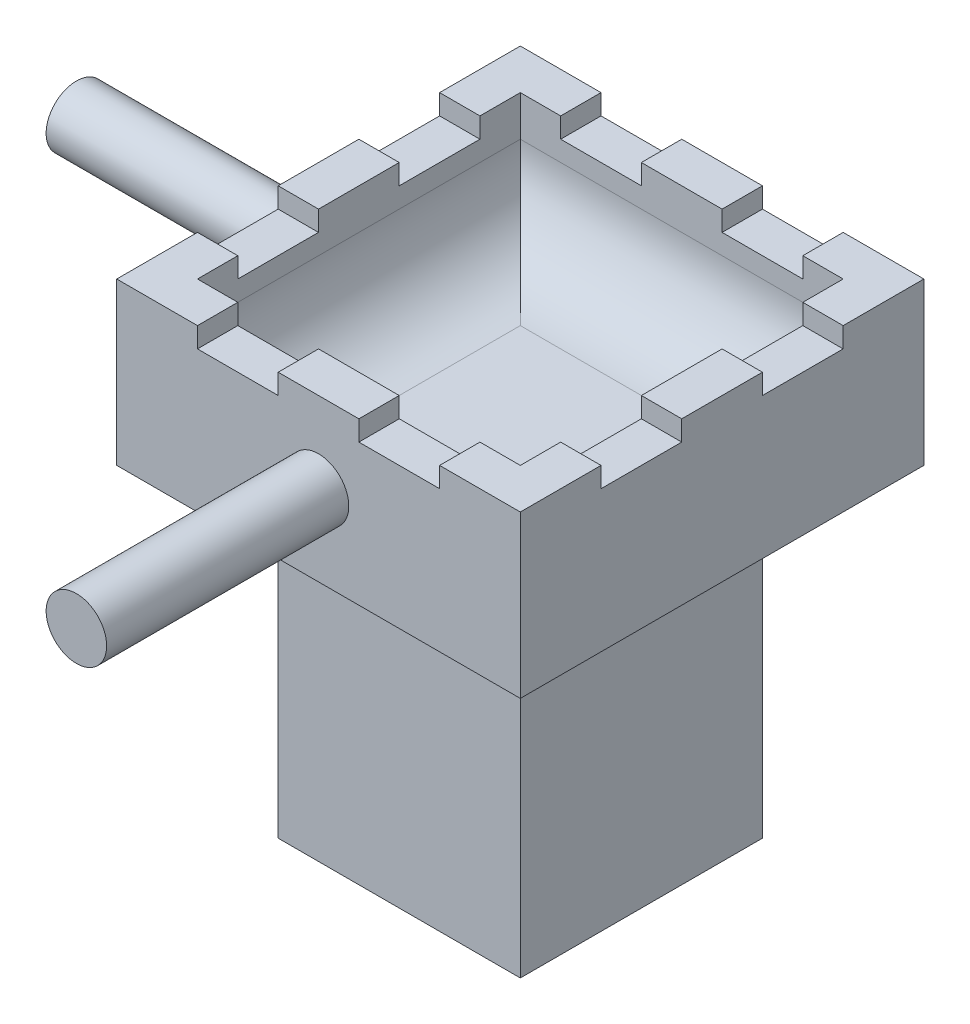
ISO-10303-21;
HEADER;
FILE_DESCRIPTION(('STEP AP214'),'2;1');
FILE_NAME('part.step','',(''),(''),'','','');
FILE_SCHEMA(('AUTOMOTIVE_DESIGN { 1 0 10303 214 1 1 1 1 }'));
ENDSEC;
DATA;
#1=APPLICATION_CONTEXT('core data for automotive mechanical design processes');
#2=APPLICATION_PROTOCOL_DEFINITION('international standard','automotive_design',2000,#1);
#3=PRODUCT_CONTEXT('',#1,'mechanical');
#4=PRODUCT('Part','Part','',(#3));
#5=PRODUCT_RELATED_PRODUCT_CATEGORY('part','',(#4));
#6=PRODUCT_DEFINITION_FORMATION('','',#4);
#7=PRODUCT_DEFINITION_CONTEXT('part definition',#1,'design');
#8=PRODUCT_DEFINITION('design','',#6,#7);
#9=PRODUCT_DEFINITION_SHAPE('','',#8);
#10=(LENGTH_UNIT() NAMED_UNIT(*) SI_UNIT(.MILLI.,.METRE.));
#11=(NAMED_UNIT(*) PLANE_ANGLE_UNIT() SI_UNIT($,.RADIAN.));
#12=(NAMED_UNIT(*) SI_UNIT($,.STERADIAN.) SOLID_ANGLE_UNIT());
#13=UNCERTAINTY_MEASURE_WITH_UNIT(LENGTH_MEASURE(1.E-05),#10,'distance_accuracy_value','');
#14=(GEOMETRIC_REPRESENTATION_CONTEXT(3) GLOBAL_UNCERTAINTY_ASSIGNED_CONTEXT((#13)) GLOBAL_UNIT_ASSIGNED_CONTEXT((#10,
#11,#12)) REPRESENTATION_CONTEXT('',''));
#15=CARTESIAN_POINT('',(0.,0.,0.));
#16=DIRECTION('',(0.,0.,1.));
#17=DIRECTION('',(1.,0.,0.));
#18=AXIS2_PLACEMENT_3D('',#15,#16,#17);
#19=CARTESIAN_POINT('',(-125.375161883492,152.4,1196.01842478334));
#20=DIRECTION('',(0.,1.,0.));
#21=DIRECTION('',(0.,0.,1.));
#22=AXIS2_PLACEMENT_3D('',#19,#20,#21);
#23=PLANE('',#22);
#24=DIRECTION('',(1.,0.,0.));
#25=VECTOR('',#24,1.);
#26=CARTESIAN_POINT('',(0.,152.4,0.));
#27=LINE('',#26,#25);
#28=CARTESIAN_POINT('',(0.,152.4,0.));
#29=VERTEX_POINT('',#28);
#30=CARTESIAN_POINT('',(76.2000000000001,152.4,0.));
#31=VERTEX_POINT('',#30);
#32=EDGE_CURVE('E40',#29,#31,#27,.T.);
#33=ORIENTED_EDGE('',*,*,#32,.F.);
#34=DIRECTION('',(0.,0.,1.));
#35=VECTOR('',#34,1.);
#36=CARTESIAN_POINT('',(0.,152.4,0.));
#37=LINE('',#36,#35);
#38=CARTESIAN_POINT('',(0.,152.4,-76.2));
#39=VERTEX_POINT('',#38);
#40=EDGE_CURVE('E46',#39,#29,#37,.T.);
#41=ORIENTED_EDGE('',*,*,#40,.F.);
#42=DIRECTION('',(1.,0.,0.));
#43=VECTOR('',#42,1.);
#44=CARTESIAN_POINT('',(-228.741421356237,152.4,-76.2));
#45=LINE('',#44,#43);
#46=CARTESIAN_POINT('',(76.2,152.4,-76.2));
#47=VERTEX_POINT('',#46);
#48=EDGE_CURVE('E379',#39,#47,#45,.T.);
#49=ORIENTED_EDGE('',*,*,#48,.T.);
#50=DIRECTION('',(0.,0.,-1.));
#51=VECTOR('',#50,1.);
#52=CARTESIAN_POINT('',(76.2,152.4,-190.5));
#53=LINE('',#52,#51);
#54=EDGE_CURVE('E383',#31,#47,#53,.T.);
#55=ORIENTED_EDGE('',*,*,#54,.F.);
#56=EDGE_LOOP('',(#33,#41,#49,#55));
#57=FACE_BOUND('',#56,.T.);
#58=ADVANCED_FACE('F37',(#57),#23,.F.);
#59=CARTESIAN_POINT('',(101.6,266.7,-406.4));
#60=DIRECTION('',(0.,-1.,0.));
#61=DIRECTION('',(0.,0.,-1.));
#62=AXIS2_PLACEMENT_3D('',#59,#60,#61);
#63=PLANE('',#62);
#64=DIRECTION('',(0.,0.,1.));
#65=VECTOR('',#64,1.);
#66=CARTESIAN_POINT('',(12.7,266.7,12.7));
#67=LINE('',#66,#65);
#68=CARTESIAN_POINT('',(12.7,266.7,-63.5));
#69=VERTEX_POINT('',#68);
#70=CARTESIAN_POINT('',(12.7,266.7,-12.7));
#71=VERTEX_POINT('',#70);
#72=EDGE_CURVE('E382',#69,#71,#67,.T.);
#73=ORIENTED_EDGE('',*,*,#72,.T.);
#74=DIRECTION('',(1.,0.,0.));
#75=VECTOR('',#74,1.);
#76=CARTESIAN_POINT('',(88.9,266.7,-12.7));
#77=LINE('',#76,#75);
#78=CARTESIAN_POINT('',(63.5,266.7,-12.7));
#79=VERTEX_POINT('',#78);
#80=EDGE_CURVE('E868',#71,#79,#77,.T.);
#81=ORIENTED_EDGE('',*,*,#80,.T.);
#82=DIRECTION('',(0.,0.,-1.));
#83=VECTOR('',#82,1.);
#84=CARTESIAN_POINT('',(63.5,266.7,-88.9));
#85=LINE('',#84,#83);
#86=CARTESIAN_POINT('',(63.5,266.7,-63.5));
#87=VERTEX_POINT('',#86);
#88=EDGE_CURVE('E871',#79,#87,#85,.T.);
#89=ORIENTED_EDGE('',*,*,#88,.T.);
#90=DIRECTION('',(-1.,0.,0.));
#91=VECTOR('',#90,1.);
#92=CARTESIAN_POINT('',(-12.6999999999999,266.7,-63.5));
#93=LINE('',#92,#91);
#94=EDGE_CURVE('E860',#87,#69,#93,.T.);
#95=ORIENTED_EDGE('',*,*,#94,.T.);
#96=EDGE_LOOP('',(#73,#81,#89,#95));
#97=FACE_BOUND('',#96,.T.);
#98=ADVANCED_FACE('F699',(#97),#63,.F.);
#99=CARTESIAN_POINT('',(63.5,292.1,-406.4));
#100=DIRECTION('',(0.,0.,1.));
#101=DIRECTION('',(1.,0.,0.));
#102=AXIS2_PLACEMENT_3D('',#99,#100,#101);
#103=CYLINDRICAL_SURFACE('',#102,25.4);
#104=CARTESIAN_POINT('',(63.5,292.1,-63.5));
#105=DIRECTION('',(0.707106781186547,0.,0.707106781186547));
#106=DIRECTION('',(0.707106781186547,0.,-0.707106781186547));
#107=AXIS2_PLACEMENT_3D('',#104,#105,#106);
#108=ELLIPSE('',#107,35.9210244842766,25.4);
#109=CARTESIAN_POINT('',(88.9,292.1,-88.9));
#110=VERTEX_POINT('',#109);
#111=EDGE_CURVE('E856',#110,#87,#108,.F.);
#112=ORIENTED_EDGE('',*,*,#111,.T.);
#113=ORIENTED_EDGE('',*,*,#88,.F.);
#114=CARTESIAN_POINT('',(63.5,292.1,-12.7));
#115=DIRECTION('',(-0.707106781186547,0.,0.707106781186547));
#116=DIRECTION('',(-0.707106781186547,0.,-0.707106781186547));
#117=AXIS2_PLACEMENT_3D('',#114,#115,#116);
#118=ELLIPSE('',#117,35.9210244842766,25.4);
#119=CARTESIAN_POINT('',(88.9,292.1,12.7));
#120=VERTEX_POINT('',#119);
#121=EDGE_CURVE('E855',#120,#79,#118,.F.);
#122=ORIENTED_EDGE('',*,*,#121,.F.);
#123=DIRECTION('',(0.,0.,-1.));
#124=VECTOR('',#123,1.);
#125=CARTESIAN_POINT('',(88.9,292.1,12.7));
#126=LINE('',#125,#124);
#127=EDGE_CURVE('E364',#110,#120,#126,.F.);
#128=ORIENTED_EDGE('',*,*,#127,.F.);
#129=EDGE_LOOP('',(#112,#113,#122,#128));
#130=FACE_BOUND('',#129,.T.);
#131=ADVANCED_FACE('F703',(#130),#103,.F.);
#132=CARTESIAN_POINT('',(101.6,292.1,-12.7));
#133=DIRECTION('',(-1.,0.,0.));
#134=DIRECTION('',(0.,0.,1.));
#135=AXIS2_PLACEMENT_3D('',#132,#133,#134);
#136=CYLINDRICAL_SURFACE('',#135,25.4);
#137=CARTESIAN_POINT('',(12.7,292.1,-12.7));
#138=DIRECTION('',(-0.707106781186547,0.,-0.707106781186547));
#139=DIRECTION('',(-0.707106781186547,0.,0.707106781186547));
#140=AXIS2_PLACEMENT_3D('',#137,#138,#139);
#141=ELLIPSE('',#140,35.9210244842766,25.4);
#142=CARTESIAN_POINT('',(-12.6999999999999,292.1,12.7));
#143=VERTEX_POINT('',#142);
#144=EDGE_CURVE('E859',#71,#143,#141,.T.);
#145=ORIENTED_EDGE('',*,*,#144,.T.);
#146=DIRECTION('',(1.,0.,0.));
#147=VECTOR('',#146,1.);
#148=CARTESIAN_POINT('',(-12.6999999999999,292.1,12.7));
#149=LINE('',#148,#147);
#150=EDGE_CURVE('E368',#120,#143,#149,.F.);
#151=ORIENTED_EDGE('',*,*,#150,.F.);
#152=ORIENTED_EDGE('',*,*,#121,.T.);
#153=ORIENTED_EDGE('',*,*,#80,.F.);
#154=EDGE_LOOP('',(#145,#151,#152,#153));
#155=FACE_BOUND('',#154,.T.);
#156=ADVANCED_FACE('F709',(#155),#136,.F.);
#157=CARTESIAN_POINT('',(101.6,292.1,-63.5));
#158=DIRECTION('',(1.,0.,0.));
#159=DIRECTION('',(0.,0.,-1.));
#160=AXIS2_PLACEMENT_3D('',#157,#158,#159);
#161=CYLINDRICAL_SURFACE('',#160,25.4);
#162=ORIENTED_EDGE('',*,*,#111,.F.);
#163=DIRECTION('',(-1.,0.,0.));
#164=VECTOR('',#163,1.);
#165=CARTESIAN_POINT('',(88.9,292.1,-88.9));
#166=LINE('',#165,#164);
#167=CARTESIAN_POINT('',(-12.6999999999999,292.1,-88.9));
#168=VERTEX_POINT('',#167);
#169=EDGE_CURVE('E443',#168,#110,#166,.F.);
#170=ORIENTED_EDGE('',*,*,#169,.F.);
#171=CARTESIAN_POINT('',(12.7,292.1,-63.5));
#172=DIRECTION('',(0.707106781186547,0.,-0.707106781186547));
#173=DIRECTION('',(-0.707106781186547,0.,-0.707106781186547));
#174=AXIS2_PLACEMENT_3D('',#171,#172,#173);
#175=ELLIPSE('',#174,35.9210244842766,25.4);
#176=EDGE_CURVE('E365',#69,#168,#175,.T.);
#177=ORIENTED_EDGE('',*,*,#176,.F.);
#178=ORIENTED_EDGE('',*,*,#94,.F.);
#179=EDGE_LOOP('',(#162,#170,#177,#178));
#180=FACE_BOUND('',#179,.T.);
#181=ADVANCED_FACE('F907',(#180),#161,.F.);
#182=CARTESIAN_POINT('',(12.7,292.1,-406.4));
#183=DIRECTION('',(0.,0.,-1.));
#184=DIRECTION('',(-1.,0.,0.));
#185=AXIS2_PLACEMENT_3D('',#182,#183,#184);
#186=CYLINDRICAL_SURFACE('',#185,25.4);
#187=ORIENTED_EDGE('',*,*,#176,.T.);
#188=DIRECTION('',(0.,0.,1.));
#189=VECTOR('',#188,1.);
#190=CARTESIAN_POINT('',(-12.6999999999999,292.1,-88.9));
#191=LINE('',#190,#189);
#192=EDGE_CURVE('E447',#143,#168,#191,.F.);
#193=ORIENTED_EDGE('',*,*,#192,.F.);
#194=ORIENTED_EDGE('',*,*,#144,.F.);
#195=ORIENTED_EDGE('',*,*,#72,.F.);
#196=EDGE_LOOP('',(#187,#193,#194,#195));
#197=FACE_BOUND('',#196,.T.);
#198=ADVANCED_FACE('F834',(#197),#186,.F.);
#199=CARTESIAN_POINT('',(38.1,279.4,101.6));
#200=DIRECTION('',(0.,0.,1.));
#201=DIRECTION('',(1.,0.,0.));
#202=AXIS2_PLACEMENT_3D('',#199,#200,#201);
#203=PLANE('',#202);
#204=CARTESIAN_POINT('',(38.1,279.4,101.6));
#205=DIRECTION('',(0.,0.,1.));
#206=DIRECTION('',(1.,0.,0.));
#207=AXIS2_PLACEMENT_3D('',#204,#205,#206);
#208=CIRCLE('',#207,9.525);
#209=CARTESIAN_POINT('',(28.575,279.4,101.6));
#210=VERTEX_POINT('',#209);
#211=EDGE_CURVE('E361',#210,#210,#208,.T.);
#212=ORIENTED_EDGE('',*,*,#211,.T.);
#213=EDGE_LOOP('',(#212));
#214=FACE_BOUND('',#213,.T.);
#215=ADVANCED_FACE('F732',(#214),#203,.T.);
#216=CARTESIAN_POINT('',(88.9,123.015902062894,12.7));
#217=DIRECTION('',(1.,0.,0.));
#218=DIRECTION('',(0.,0.,-1.));
#219=AXIS2_PLACEMENT_3D('',#216,#217,#218);
#220=PLANE('',#219);
#221=DIRECTION('',(0.,1.,0.));
#222=VECTOR('',#221,1.);
#223=CARTESIAN_POINT('',(88.9,123.015902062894,-88.9));
#224=LINE('',#223,#222);
#225=CARTESIAN_POINT('',(88.9,304.8,-88.9));
#226=VERTEX_POINT('',#225);
#227=EDGE_CURVE('E440',#110,#226,#224,.T.);
#228=ORIENTED_EDGE('',*,*,#227,.F.);
#229=ORIENTED_EDGE('',*,*,#127,.T.);
#230=DIRECTION('',(0.,1.,0.));
#231=VECTOR('',#230,1.);
#232=CARTESIAN_POINT('',(88.9,123.015902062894,12.7));
#233=LINE('',#232,#231);
#234=CARTESIAN_POINT('',(88.9,304.8,12.7));
#235=VERTEX_POINT('',#234);
#236=EDGE_CURVE('E451',#120,#235,#233,.T.);
#237=ORIENTED_EDGE('',*,*,#236,.T.);
#238=DIRECTION('',(0.,0.,-1.));
#239=VECTOR('',#238,1.);
#240=CARTESIAN_POINT('',(88.9,304.8,12.7));
#241=LINE('',#240,#239);
#242=CARTESIAN_POINT('',(88.9,304.8,0.));
#243=VERTEX_POINT('',#242);
#244=EDGE_CURVE('E453',#235,#243,#241,.T.);
#245=ORIENTED_EDGE('',*,*,#244,.T.);
#246=DIRECTION('',(0.,-1.,0.));
#247=VECTOR('',#246,1.);
#248=CARTESIAN_POINT('',(88.9,123.015902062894,0.));
#249=LINE('',#248,#247);
#250=CARTESIAN_POINT('',(88.9,298.45,0.));
#251=VERTEX_POINT('',#250);
#252=EDGE_CURVE('E456',#243,#251,#249,.T.);
#253=ORIENTED_EDGE('',*,*,#252,.T.);
#254=DIRECTION('',(0.,0.,-1.));
#255=VECTOR('',#254,1.);
#256=CARTESIAN_POINT('',(88.9,298.45,12.7));
#257=LINE('',#256,#255);
#258=CARTESIAN_POINT('',(88.9,298.45,-25.4));
#259=VERTEX_POINT('',#258);
#260=EDGE_CURVE('E655',#251,#259,#257,.T.);
#261=ORIENTED_EDGE('',*,*,#260,.T.);
#262=DIRECTION('',(0.,-1.,0.));
#263=VECTOR('',#262,1.);
#264=CARTESIAN_POINT('',(88.9,123.015902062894,-25.4));
#265=LINE('',#264,#263);
#266=CARTESIAN_POINT('',(88.9,304.8,-25.4));
#267=VERTEX_POINT('',#266);
#268=EDGE_CURVE('E517',#267,#259,#265,.T.);
#269=ORIENTED_EDGE('',*,*,#268,.F.);
#270=CARTESIAN_POINT('',(88.9,304.8,-50.8));
#271=VERTEX_POINT('',#270);
#272=EDGE_CURVE('E457',#267,#271,#241,.T.);
#273=ORIENTED_EDGE('',*,*,#272,.T.);
#274=DIRECTION('',(0.,-1.,0.));
#275=VECTOR('',#274,1.);
#276=CARTESIAN_POINT('',(88.9,123.015902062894,-50.8));
#277=LINE('',#276,#275);
#278=CARTESIAN_POINT('',(88.9,298.45,-50.8));
#279=VERTEX_POINT('',#278);
#280=EDGE_CURVE('E649',#271,#279,#277,.T.);
#281=ORIENTED_EDGE('',*,*,#280,.T.);
#282=DIRECTION('',(0.,0.,-1.));
#283=VECTOR('',#282,1.);
#284=CARTESIAN_POINT('',(88.9,298.45,12.7));
#285=LINE('',#284,#283);
#286=CARTESIAN_POINT('',(88.9,298.45,-76.1999999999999));
#287=VERTEX_POINT('',#286);
#288=EDGE_CURVE('E652',#279,#287,#285,.T.);
#289=ORIENTED_EDGE('',*,*,#288,.T.);
#290=DIRECTION('',(0.,-1.,0.));
#291=VECTOR('',#290,1.);
#292=CARTESIAN_POINT('',(88.9,123.015902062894,-76.1999999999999));
#293=LINE('',#292,#291);
#294=CARTESIAN_POINT('',(88.9,304.8,-76.1999999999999));
#295=VERTEX_POINT('',#294);
#296=EDGE_CURVE('E536',#295,#287,#293,.T.);
#297=ORIENTED_EDGE('',*,*,#296,.F.);
#298=EDGE_CURVE('E369',#295,#226,#241,.T.);
#299=ORIENTED_EDGE('',*,*,#298,.T.);
#300=EDGE_LOOP('',(#228,#229,#237,#245,#253,#261,#269,#273,#281,#289,#297,#299));
#301=FACE_BOUND('',#300,.T.);
#302=ADVANCED_FACE('F729',(#301),#220,.F.);
#303=CARTESIAN_POINT('',(-101.6,279.4,-38.1));
#304=DIRECTION('',(-1.,0.,0.));
#305=DIRECTION('',(0.,0.,1.));
#306=AXIS2_PLACEMENT_3D('',#303,#304,#305);
#307=PLANE('',#306);
#308=CARTESIAN_POINT('',(-101.6,279.4,-38.1));
#309=DIRECTION('',(-1.,0.,0.));
#310=DIRECTION('',(0.,0.,1.));
#311=AXIS2_PLACEMENT_3D('',#308,#309,#310);
#312=CIRCLE('',#311,9.525);
#313=CARTESIAN_POINT('',(-101.6,279.4,-47.625));
#314=VERTEX_POINT('',#313);
#315=EDGE_CURVE('E366',#314,#314,#312,.T.);
#316=ORIENTED_EDGE('',*,*,#315,.T.);
#317=EDGE_LOOP('',(#316));
#318=FACE_BOUND('',#317,.T.);
#319=ADVANCED_FACE('F727',(#318),#307,.T.);
#320=CARTESIAN_POINT('',(-12.6999999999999,123.015902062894,12.7));
#321=DIRECTION('',(0.,0.,1.));
#322=DIRECTION('',(1.,0.,0.));
#323=AXIS2_PLACEMENT_3D('',#320,#321,#322);
#324=PLANE('',#323);
#325=ORIENTED_EDGE('',*,*,#236,.F.);
#326=ORIENTED_EDGE('',*,*,#150,.T.);
#327=DIRECTION('',(0.,1.,0.));
#328=VECTOR('',#327,1.);
#329=CARTESIAN_POINT('',(-12.6999999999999,123.015902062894,12.7));
#330=LINE('',#329,#328);
#331=CARTESIAN_POINT('',(-12.6999999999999,304.8,12.7));
#332=VERTEX_POINT('',#331);
#333=EDGE_CURVE('E448',#143,#332,#330,.T.);
#334=ORIENTED_EDGE('',*,*,#333,.T.);
#335=DIRECTION('',(1.,0.,0.));
#336=VECTOR('',#335,1.);
#337=CARTESIAN_POINT('',(-12.6999999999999,304.8,12.7));
#338=LINE('',#337,#336);
#339=CARTESIAN_POINT('',(0.,304.8,12.7));
#340=VERTEX_POINT('',#339);
#341=EDGE_CURVE('E450',#332,#340,#338,.T.);
#342=ORIENTED_EDGE('',*,*,#341,.T.);
#343=DIRECTION('',(0.,-1.,0.));
#344=VECTOR('',#343,1.);
#345=CARTESIAN_POINT('',(0.,123.015902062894,12.7));
#346=LINE('',#345,#344);
#347=CARTESIAN_POINT('',(0.,298.45,12.7));
#348=VERTEX_POINT('',#347);
#349=EDGE_CURVE('E470',#340,#348,#346,.T.);
#350=ORIENTED_EDGE('',*,*,#349,.T.);
#351=DIRECTION('',(-1.,0.,0.));
#352=VECTOR('',#351,1.);
#353=CARTESIAN_POINT('',(-12.6999999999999,298.45,12.7));
#354=LINE('',#353,#352);
#355=CARTESIAN_POINT('',(25.4,298.45,12.7));
#356=VERTEX_POINT('',#355);
#357=EDGE_CURVE('E333',#356,#348,#354,.T.);
#358=ORIENTED_EDGE('',*,*,#357,.F.);
#359=DIRECTION('',(0.,-1.,0.));
#360=VECTOR('',#359,1.);
#361=CARTESIAN_POINT('',(25.4,123.015902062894,12.7));
#362=LINE('',#361,#360);
#363=CARTESIAN_POINT('',(25.4,304.8,12.7));
#364=VERTEX_POINT('',#363);
#365=EDGE_CURVE('E600',#364,#356,#362,.T.);
#366=ORIENTED_EDGE('',*,*,#365,.F.);
#367=CARTESIAN_POINT('',(50.8,304.8,12.7));
#368=VERTEX_POINT('',#367);
#369=EDGE_CURVE('E471',#364,#368,#338,.T.);
#370=ORIENTED_EDGE('',*,*,#369,.T.);
#371=DIRECTION('',(0.,-1.,0.));
#372=VECTOR('',#371,1.);
#373=CARTESIAN_POINT('',(50.8,123.015902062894,12.7));
#374=LINE('',#373,#372);
#375=CARTESIAN_POINT('',(50.8,298.45,12.7));
#376=VERTEX_POINT('',#375);
#377=EDGE_CURVE('E879',#368,#376,#374,.T.);
#378=ORIENTED_EDGE('',*,*,#377,.T.);
#379=DIRECTION('',(-1.,0.,0.));
#380=VECTOR('',#379,1.);
#381=CARTESIAN_POINT('',(-12.6999999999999,298.45,12.7));
#382=LINE('',#381,#380);
#383=CARTESIAN_POINT('',(76.2,298.45,12.7));
#384=VERTEX_POINT('',#383);
#385=EDGE_CURVE('E581',#384,#376,#382,.T.);
#386=ORIENTED_EDGE('',*,*,#385,.F.);
#387=DIRECTION('',(0.,-1.,0.));
#388=VECTOR('',#387,1.);
#389=CARTESIAN_POINT('',(76.2,123.015902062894,12.7));
#390=LINE('',#389,#388);
#391=CARTESIAN_POINT('',(76.2,304.8,12.7));
#392=VERTEX_POINT('',#391);
#393=EDGE_CURVE('E580',#392,#384,#390,.T.);
#394=ORIENTED_EDGE('',*,*,#393,.F.);
#395=EDGE_CURVE('E472',#392,#235,#338,.T.);
#396=ORIENTED_EDGE('',*,*,#395,.T.);
#397=EDGE_LOOP('',(#325,#326,#334,#342,#350,#358,#366,#370,#378,#386,#394,#396));
#398=FACE_BOUND('',#397,.T.);
#399=ADVANCED_FACE('F719',(#398),#324,.F.);
#400=CARTESIAN_POINT('',(-12.6999999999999,123.015902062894,-88.9));
#401=DIRECTION('',(0.,0.,-1.));
#402=DIRECTION('',(-1.,0.,0.));
#403=AXIS2_PLACEMENT_3D('',#400,#401,#402);
#404=PLANE('',#403);
#405=DIRECTION('',(0.,1.,0.));
#406=VECTOR('',#405,1.);
#407=CARTESIAN_POINT('',(-12.6999999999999,123.015902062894,-88.9));
#408=LINE('',#407,#406);
#409=CARTESIAN_POINT('',(-12.6999999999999,304.8,-88.9));
#410=VERTEX_POINT('',#409);
#411=EDGE_CURVE('E444',#168,#410,#408,.T.);
#412=ORIENTED_EDGE('',*,*,#411,.F.);
#413=ORIENTED_EDGE('',*,*,#169,.T.);
#414=ORIENTED_EDGE('',*,*,#227,.T.);
#415=DIRECTION('',(-1.,0.,0.));
#416=VECTOR('',#415,1.);
#417=CARTESIAN_POINT('',(-12.6999999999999,304.8,-88.9));
#418=LINE('',#417,#416);
#419=CARTESIAN_POINT('',(76.2,304.8,-88.9));
#420=VERTEX_POINT('',#419);
#421=EDGE_CURVE('E442',#226,#420,#418,.T.);
#422=ORIENTED_EDGE('',*,*,#421,.T.);
#423=DIRECTION('',(0.,-1.,0.));
#424=VECTOR('',#423,1.);
#425=CARTESIAN_POINT('',(76.2,123.015902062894,-88.9));
#426=LINE('',#425,#424);
#427=CARTESIAN_POINT('',(76.2,298.45,-88.9));
#428=VERTEX_POINT('',#427);
#429=EDGE_CURVE('E460',#420,#428,#426,.T.);
#430=ORIENTED_EDGE('',*,*,#429,.T.);
#431=DIRECTION('',(-1.,0.,0.));
#432=VECTOR('',#431,1.);
#433=CARTESIAN_POINT('',(-12.6999999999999,298.45,-88.9));
#434=LINE('',#433,#432);
#435=CARTESIAN_POINT('',(50.8,298.45,-88.9));
#436=VERTEX_POINT('',#435);
#437=EDGE_CURVE('E893',#428,#436,#434,.T.);
#438=ORIENTED_EDGE('',*,*,#437,.T.);
#439=DIRECTION('',(0.,-1.,0.));
#440=VECTOR('',#439,1.);
#441=CARTESIAN_POINT('',(50.8,123.015902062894,-88.9));
#442=LINE('',#441,#440);
#443=CARTESIAN_POINT('',(50.8,304.8,-88.9));
#444=VERTEX_POINT('',#443);
#445=EDGE_CURVE('E553',#444,#436,#442,.T.);
#446=ORIENTED_EDGE('',*,*,#445,.F.);
#447=CARTESIAN_POINT('',(25.4,304.8,-88.9));
#448=VERTEX_POINT('',#447);
#449=EDGE_CURVE('E462',#444,#448,#418,.T.);
#450=ORIENTED_EDGE('',*,*,#449,.T.);
#451=DIRECTION('',(0.,-1.,0.));
#452=VECTOR('',#451,1.);
#453=CARTESIAN_POINT('',(25.4,123.015902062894,-88.9));
#454=LINE('',#453,#452);
#455=CARTESIAN_POINT('',(25.4,298.45,-88.9));
#456=VERTEX_POINT('',#455);
#457=EDGE_CURVE('E889',#448,#456,#454,.T.);
#458=ORIENTED_EDGE('',*,*,#457,.T.);
#459=DIRECTION('',(-1.,0.,0.));
#460=VECTOR('',#459,1.);
#461=CARTESIAN_POINT('',(-12.6999999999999,298.45,-88.9));
#462=LINE('',#461,#460);
#463=CARTESIAN_POINT('',(0.,298.45,-88.9));
#464=VERTEX_POINT('',#463);
#465=EDGE_CURVE('E886',#456,#464,#462,.T.);
#466=ORIENTED_EDGE('',*,*,#465,.T.);
#467=DIRECTION('',(0.,-1.,0.));
#468=VECTOR('',#467,1.);
#469=CARTESIAN_POINT('',(0.,123.015902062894,-88.9));
#470=LINE('',#469,#468);
#471=CARTESIAN_POINT('',(0.,304.8,-88.9));
#472=VERTEX_POINT('',#471);
#473=EDGE_CURVE('E571',#472,#464,#470,.T.);
#474=ORIENTED_EDGE('',*,*,#473,.F.);
#475=EDGE_CURVE('E461',#472,#410,#418,.T.);
#476=ORIENTED_EDGE('',*,*,#475,.T.);
#477=EDGE_LOOP('',(#412,#413,#414,#422,#430,#438,#446,#450,#458,#466,#474,#476));
#478=FACE_BOUND('',#477,.T.);
#479=ADVANCED_FACE('F715',(#478),#404,.F.);
#480=CARTESIAN_POINT('',(-12.6999999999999,123.015902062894,12.7));
#481=DIRECTION('',(-1.,0.,0.));
#482=DIRECTION('',(0.,0.,1.));
#483=AXIS2_PLACEMENT_3D('',#480,#481,#482);
#484=PLANE('',#483);
#485=ORIENTED_EDGE('',*,*,#333,.F.);
#486=ORIENTED_EDGE('',*,*,#192,.T.);
#487=ORIENTED_EDGE('',*,*,#411,.T.);
#488=DIRECTION('',(0.,0.,1.));
#489=VECTOR('',#488,1.);
#490=CARTESIAN_POINT('',(-12.6999999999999,304.8,12.7));
#491=LINE('',#490,#489);
#492=CARTESIAN_POINT('',(-12.6999999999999,304.8,-76.1999999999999));
#493=VERTEX_POINT('',#492);
#494=EDGE_CURVE('E446',#410,#493,#491,.T.);
#495=ORIENTED_EDGE('',*,*,#494,.T.);
#496=DIRECTION('',(0.,-1.,0.));
#497=VECTOR('',#496,1.);
#498=CARTESIAN_POINT('',(-12.6999999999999,123.015902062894,-76.1999999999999));
#499=LINE('',#498,#497);
#500=CARTESIAN_POINT('',(-12.6999999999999,298.45,-76.1999999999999));
#501=VERTEX_POINT('',#500);
#502=EDGE_CURVE('E465',#493,#501,#499,.T.);
#503=ORIENTED_EDGE('',*,*,#502,.T.);
#504=DIRECTION('',(0.,0.,-1.));
#505=VECTOR('',#504,1.);
#506=CARTESIAN_POINT('',(-12.6999999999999,298.45,12.7));
#507=LINE('',#506,#505);
#508=CARTESIAN_POINT('',(-12.6999999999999,298.45,-50.7999999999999));
#509=VERTEX_POINT('',#508);
#510=EDGE_CURVE('E356',#509,#501,#507,.T.);
#511=ORIENTED_EDGE('',*,*,#510,.F.);
#512=DIRECTION('',(0.,-1.,0.));
#513=VECTOR('',#512,1.);
#514=CARTESIAN_POINT('',(-12.6999999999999,123.015902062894,-50.7999999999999));
#515=LINE('',#514,#513);
#516=CARTESIAN_POINT('',(-12.6999999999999,304.8,-50.8));
#517=VERTEX_POINT('',#516);
#518=EDGE_CURVE('E496',#517,#509,#515,.T.);
#519=ORIENTED_EDGE('',*,*,#518,.F.);
#520=CARTESIAN_POINT('',(-12.6999999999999,304.8,-25.4));
#521=VERTEX_POINT('',#520);
#522=EDGE_CURVE('E466',#517,#521,#491,.T.);
#523=ORIENTED_EDGE('',*,*,#522,.T.);
#524=DIRECTION('',(0.,-1.,0.));
#525=VECTOR('',#524,1.);
#526=CARTESIAN_POINT('',(-12.6999999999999,123.015902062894,-25.4));
#527=LINE('',#526,#525);
#528=CARTESIAN_POINT('',(-12.6999999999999,298.45,-25.4));
#529=VERTEX_POINT('',#528);
#530=EDGE_CURVE('E668',#521,#529,#527,.T.);
#531=ORIENTED_EDGE('',*,*,#530,.T.);
#532=DIRECTION('',(0.,0.,-1.));
#533=VECTOR('',#532,1.);
#534=CARTESIAN_POINT('',(-12.6999999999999,298.45,12.7));
#535=LINE('',#534,#533);
#536=CARTESIAN_POINT('',(-12.6999999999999,298.45,0.));
#537=VERTEX_POINT('',#536);
#538=EDGE_CURVE('E476',#537,#529,#535,.T.);
#539=ORIENTED_EDGE('',*,*,#538,.F.);
#540=DIRECTION('',(0.,-1.,0.));
#541=VECTOR('',#540,1.);
#542=CARTESIAN_POINT('',(-12.6999999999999,123.015902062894,0.));
#543=LINE('',#542,#541);
#544=CARTESIAN_POINT('',(-12.7,304.8,0.));
#545=VERTEX_POINT('',#544);
#546=EDGE_CURVE('E475',#545,#537,#543,.T.);
#547=ORIENTED_EDGE('',*,*,#546,.F.);
#548=EDGE_CURVE('E467',#545,#332,#491,.T.);
#549=ORIENTED_EDGE('',*,*,#548,.T.);
#550=EDGE_LOOP('',(#485,#486,#487,#495,#503,#511,#519,#523,#531,#539,#547,#549));
#551=FACE_BOUND('',#550,.T.);
#552=ADVANCED_FACE('F718',(#551),#484,.F.);
#553=CARTESIAN_POINT('',(38.1,279.4,101.6));
#554=DIRECTION('',(0.,0.,-1.));
#555=DIRECTION('',(-1.,0.,0.));
#556=AXIS2_PLACEMENT_3D('',#553,#554,#555);
#557=CYLINDRICAL_SURFACE('',#556,9.525);
#558=CARTESIAN_POINT('',(38.1,279.4,25.4));
#559=DIRECTION('',(0.,0.,-1.));
#560=DIRECTION('',(-1.,0.,0.));
#561=AXIS2_PLACEMENT_3D('',#558,#559,#560);
#562=CIRCLE('',#561,9.525);
#563=CARTESIAN_POINT('',(28.575,279.4,25.4));
#564=VERTEX_POINT('',#563);
#565=EDGE_CURVE('E850',#564,#564,#562,.F.);
#566=CARTESIAN_POINT('',(28.575,279.4,101.6));
#567=CARTESIAN_POINT('',(28.575,279.4,100.80625));
#568=CARTESIAN_POINT('',(28.575,279.4,100.0125));
#569=CARTESIAN_POINT('',(28.575,279.4,98.425));
#570=CARTESIAN_POINT('',(28.575,279.4,97.63125));
#571=CARTESIAN_POINT('',(28.575,279.4,96.04375));
#572=CARTESIAN_POINT('',(28.575,279.4,95.25));
#573=CARTESIAN_POINT('',(28.575,279.4,93.6625));
#574=CARTESIAN_POINT('',(28.575,279.4,92.86875));
#575=CARTESIAN_POINT('',(28.575,279.4,91.28125));
#576=CARTESIAN_POINT('',(28.575,279.4,90.4875));
#577=CARTESIAN_POINT('',(28.575,279.4,88.9));
#578=CARTESIAN_POINT('',(28.575,279.4,88.10625));
#579=CARTESIAN_POINT('',(28.575,279.4,86.51875));
#580=CARTESIAN_POINT('',(28.575,279.4,85.725));
#581=CARTESIAN_POINT('',(28.575,279.4,84.1375));
#582=CARTESIAN_POINT('',(28.575,279.4,83.34375));
#583=CARTESIAN_POINT('',(28.575,279.4,81.75625));
#584=CARTESIAN_POINT('',(28.575,279.4,80.9625));
#585=CARTESIAN_POINT('',(28.575,279.4,79.375));
#586=CARTESIAN_POINT('',(28.575,279.4,78.58125));
#587=CARTESIAN_POINT('',(28.575,279.4,76.99375));
#588=CARTESIAN_POINT('',(28.575,279.4,76.2));
#589=CARTESIAN_POINT('',(28.575,279.4,74.6125));
#590=CARTESIAN_POINT('',(28.575,279.4,73.81875));
#591=CARTESIAN_POINT('',(28.575,279.4,72.23125));
#592=CARTESIAN_POINT('',(28.575,279.4,71.4375));
#593=CARTESIAN_POINT('',(28.575,279.4,69.85));
#594=CARTESIAN_POINT('',(28.575,279.4,69.05625));
#595=CARTESIAN_POINT('',(28.575,279.4,67.46875));
#596=CARTESIAN_POINT('',(28.575,279.4,66.675));
#597=CARTESIAN_POINT('',(28.575,279.4,65.0875));
#598=CARTESIAN_POINT('',(28.575,279.4,64.29375));
#599=CARTESIAN_POINT('',(28.575,279.4,62.70625));
#600=CARTESIAN_POINT('',(28.575,279.4,61.9125));
#601=CARTESIAN_POINT('',(28.575,279.4,60.325));
#602=CARTESIAN_POINT('',(28.575,279.4,59.53125));
#603=CARTESIAN_POINT('',(28.575,279.4,57.94375));
#604=CARTESIAN_POINT('',(28.575,279.4,57.15));
#605=CARTESIAN_POINT('',(28.575,279.4,55.5625));
#606=CARTESIAN_POINT('',(28.575,279.4,54.76875));
#607=CARTESIAN_POINT('',(28.575,279.4,53.18125));
#608=CARTESIAN_POINT('',(28.575,279.4,52.3875));
#609=CARTESIAN_POINT('',(28.575,279.4,50.8));
#610=CARTESIAN_POINT('',(28.575,279.4,50.00625));
#611=CARTESIAN_POINT('',(28.575,279.4,48.41875));
#612=CARTESIAN_POINT('',(28.575,279.4,47.625));
#613=CARTESIAN_POINT('',(28.575,279.4,46.0375));
#614=CARTESIAN_POINT('',(28.575,279.4,45.24375));
#615=CARTESIAN_POINT('',(28.575,279.4,43.65625));
#616=CARTESIAN_POINT('',(28.575,279.4,42.8625));
#617=CARTESIAN_POINT('',(28.575,279.4,41.275));
#618=CARTESIAN_POINT('',(28.575,279.4,40.48125));
#619=CARTESIAN_POINT('',(28.575,279.4,38.89375));
#620=CARTESIAN_POINT('',(28.575,279.4,38.1));
#621=CARTESIAN_POINT('',(28.575,279.4,36.5125));
#622=CARTESIAN_POINT('',(28.575,279.4,35.71875));
#623=CARTESIAN_POINT('',(28.575,279.4,34.13125));
#624=CARTESIAN_POINT('',(28.575,279.4,33.3375));
#625=CARTESIAN_POINT('',(28.575,279.4,31.75));
#626=CARTESIAN_POINT('',(28.575,279.4,30.95625));
#627=CARTESIAN_POINT('',(28.575,279.4,29.36875));
#628=CARTESIAN_POINT('',(28.575,279.4,28.575));
#629=CARTESIAN_POINT('',(28.575,279.4,26.9875));
#630=CARTESIAN_POINT('',(28.575,279.4,26.19375));
#631=CARTESIAN_POINT('',(28.575,279.4,25.4));
#632=B_SPLINE_CURVE_WITH_KNOTS('',3,(#566,#567,#568,#569,#570,#571,#572,#573,#574,#575,#576,
#577,#578,#579,#580,#581,#582,#583,#584,#585,#586,#587,#588,#589,#590,#591,#592,#593,#594,#595,
#596,#597,#598,#599,#600,#601,#602,#603,#604,#605,#606,#607,#608,#609,#610,#611,#612,#613,#614,
#615,#616,#617,#618,#619,#620,#621,#622,#623,#624,#625,#626,#627,#628,#629,#630,#631),
.UNSPECIFIED.,.F.,.F.,(4,2,2,2,2,2,2,2,2,2,2,2,2,2,2,2,2,2,2,2,2,2,2,2,2,2,2,2,2,2,2,2,4),(0.,
2.38125,4.7625,7.14375,9.52500000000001,11.90625,14.2875,16.66875,19.05,21.43125,23.8125,
26.19375,28.575,30.95625,33.3375,35.71875,38.1,40.48125,42.8625,45.24375,47.625,50.00625,
52.3875,54.76875,57.15,59.53125,61.9125,64.29375,66.675,69.05625,71.4375,73.81875,76.2),.UNSPECIFIED.);
#633=EDGE_CURVE('BSEAM723',#210,#564,#632,.T.);
#634=ORIENTED_EDGE('',*,*,#211,.F.);
#635=ORIENTED_EDGE('',*,*,#565,.T.);
#636=ORIENTED_EDGE('',*,*,#633,.T.);
#637=ORIENTED_EDGE('',*,*,#633,.F.);
#638=EDGE_LOOP('',(#634,#636,#635,#637));
#639=FACE_BOUND('',#638,.T.);
#640=ADVANCED_FACE('F723',(#639),#557,.T.);
#641=CARTESIAN_POINT('',(25.4,280.860288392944,-25.4));
#642=DIRECTION('',(-1.,0.,0.));
#643=DIRECTION('',(0.,0.,1.));
#644=AXIS2_PLACEMENT_3D('',#641,#642,#643);
#645=PLANE('',#644);
#646=ORIENTED_EDGE('',*,*,#365,.T.);
#647=DIRECTION('',(0.,0.,1.));
#648=VECTOR('',#647,1.);
#649=CARTESIAN_POINT('',(25.4,298.45,-25.4));
#650=LINE('',#649,#648);
#651=CARTESIAN_POINT('',(25.4,298.45,25.4));
#652=VERTEX_POINT('',#651);
#653=EDGE_CURVE('E597',#356,#652,#650,.T.);
#654=ORIENTED_EDGE('',*,*,#653,.T.);
#655=DIRECTION('',(0.,-1.,0.));
#656=VECTOR('',#655,1.);
#657=CARTESIAN_POINT('',(25.4,280.860288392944,25.4));
#658=LINE('',#657,#656);
#659=CARTESIAN_POINT('',(25.4,304.8,25.4));
#660=VERTEX_POINT('',#659);
#661=EDGE_CURVE('E350',#660,#652,#658,.T.);
#662=ORIENTED_EDGE('',*,*,#661,.F.);
#663=DIRECTION('',(0.,0.,1.));
#664=VECTOR('',#663,1.);
#665=CARTESIAN_POINT('',(25.4,304.8,-25.4));
#666=LINE('',#665,#664);
#667=EDGE_CURVE('E599',#364,#660,#666,.T.);
#668=ORIENTED_EDGE('',*,*,#667,.F.);
#669=EDGE_LOOP('',(#646,#654,#662,#668));
#670=FACE_BOUND('',#669,.T.);
#671=ADVANCED_FACE('F825',(#670),#645,.T.);
#672=CARTESIAN_POINT('',(-228.741421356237,304.8,-190.5));
#673=DIRECTION('',(0.,1.,0.));
#674=DIRECTION('',(0.,0.,1.));
#675=AXIS2_PLACEMENT_3D('',#672,#673,#674);
#676=PLANE('',#675);
#677=ORIENTED_EDGE('',*,*,#369,.F.);
#678=ORIENTED_EDGE('',*,*,#667,.T.);
#679=DIRECTION('',(1.,0.,0.));
#680=VECTOR('',#679,1.);
#681=CARTESIAN_POINT('',(101.6,304.8,25.4));
#682=LINE('',#681,#680);
#683=CARTESIAN_POINT('',(50.8,304.8,25.4));
#684=VERTEX_POINT('',#683);
#685=EDGE_CURVE('E422',#660,#684,#682,.T.);
#686=ORIENTED_EDGE('',*,*,#685,.T.);
#687=DIRECTION('',(0.,0.,1.));
#688=VECTOR('',#687,1.);
#689=CARTESIAN_POINT('',(50.8,304.8,-25.4));
#690=LINE('',#689,#688);
#691=EDGE_CURVE('E586',#368,#684,#690,.T.);
#692=ORIENTED_EDGE('',*,*,#691,.F.);
#693=EDGE_LOOP('',(#677,#678,#686,#692));
#694=FACE_BOUND('',#693,.T.);
#695=ADVANCED_FACE('F812',(#694),#676,.T.);
#696=CARTESIAN_POINT('',(50.8,280.860288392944,-25.4));
#697=DIRECTION('',(-1.,0.,0.));
#698=DIRECTION('',(0.,0.,1.));
#699=AXIS2_PLACEMENT_3D('',#696,#697,#698);
#700=PLANE('',#699);
#701=ORIENTED_EDGE('',*,*,#691,.T.);
#702=DIRECTION('',(0.,-1.,0.));
#703=VECTOR('',#702,1.);
#704=CARTESIAN_POINT('',(50.8,280.860288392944,25.4));
#705=LINE('',#704,#703);
#706=CARTESIAN_POINT('',(50.8,298.45,25.4));
#707=VERTEX_POINT('',#706);
#708=EDGE_CURVE('E589',#684,#707,#705,.T.);
#709=ORIENTED_EDGE('',*,*,#708,.T.);
#710=DIRECTION('',(0.,0.,1.));
#711=VECTOR('',#710,1.);
#712=CARTESIAN_POINT('',(50.8,298.45,-25.4));
#713=LINE('',#712,#711);
#714=EDGE_CURVE('E578',#376,#707,#713,.T.);
#715=ORIENTED_EDGE('',*,*,#714,.F.);
#716=ORIENTED_EDGE('',*,*,#377,.F.);
#717=EDGE_LOOP('',(#701,#709,#715,#716));
#718=FACE_BOUND('',#717,.T.);
#719=ADVANCED_FACE('F808',(#718),#700,.F.);
#720=CARTESIAN_POINT('',(-77.5357299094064,298.45,-25.4));
#721=DIRECTION('',(0.,1.,0.));
#722=DIRECTION('',(0.,0.,1.));
#723=AXIS2_PLACEMENT_3D('',#720,#721,#722);
#724=PLANE('',#723);
#725=ORIENTED_EDGE('',*,*,#385,.T.);
#726=ORIENTED_EDGE('',*,*,#714,.T.);
#727=DIRECTION('',(-1.,0.,0.));
#728=VECTOR('',#727,1.);
#729=CARTESIAN_POINT('',(-77.5357299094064,298.45,25.4));
#730=LINE('',#729,#728);
#731=CARTESIAN_POINT('',(76.2,298.45,25.4));
#732=VERTEX_POINT('',#731);
#733=EDGE_CURVE('E592',#732,#707,#730,.T.);
#734=ORIENTED_EDGE('',*,*,#733,.F.);
#735=DIRECTION('',(0.,0.,1.));
#736=VECTOR('',#735,1.);
#737=CARTESIAN_POINT('',(76.2,298.45,-25.4));
#738=LINE('',#737,#736);
#739=EDGE_CURVE('E582',#384,#732,#738,.T.);
#740=ORIENTED_EDGE('',*,*,#739,.F.);
#741=EDGE_LOOP('',(#725,#726,#734,#740));
#742=FACE_BOUND('',#741,.T.);
#743=ADVANCED_FACE('F811',(#742),#724,.T.);
#744=CARTESIAN_POINT('',(76.2,280.860288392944,-25.4));
#745=DIRECTION('',(-1.,0.,0.));
#746=DIRECTION('',(0.,0.,1.));
#747=AXIS2_PLACEMENT_3D('',#744,#745,#746);
#748=PLANE('',#747);
#749=ORIENTED_EDGE('',*,*,#393,.T.);
#750=ORIENTED_EDGE('',*,*,#739,.T.);
#751=DIRECTION('',(0.,-1.,0.));
#752=VECTOR('',#751,1.);
#753=CARTESIAN_POINT('',(76.2,280.860288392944,25.4));
#754=LINE('',#753,#752);
#755=CARTESIAN_POINT('',(76.2,304.8,25.4));
#756=VERTEX_POINT('',#755);
#757=EDGE_CURVE('E434',#756,#732,#754,.T.);
#758=ORIENTED_EDGE('',*,*,#757,.F.);
#759=DIRECTION('',(0.,0.,1.));
#760=VECTOR('',#759,1.);
#761=CARTESIAN_POINT('',(76.2,304.8,-25.4));
#762=LINE('',#761,#760);
#763=EDGE_CURVE('E336',#392,#756,#762,.T.);
#764=ORIENTED_EDGE('',*,*,#763,.F.);
#765=EDGE_LOOP('',(#749,#750,#758,#764));
#766=FACE_BOUND('',#765,.T.);
#767=ADVANCED_FACE('F816',(#766),#748,.T.);
#768=CARTESIAN_POINT('',(0.,280.860288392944,-25.4));
#769=DIRECTION('',(-1.,0.,0.));
#770=DIRECTION('',(0.,0.,1.));
#771=AXIS2_PLACEMENT_3D('',#768,#769,#770);
#772=PLANE('',#771);
#773=DIRECTION('',(0.,0.,1.));
#774=VECTOR('',#773,1.);
#775=CARTESIAN_POINT('',(0.,304.8,-25.4));
#776=LINE('',#775,#774);
#777=CARTESIAN_POINT('',(0.,304.8,25.4));
#778=VERTEX_POINT('',#777);
#779=EDGE_CURVE('E342',#340,#778,#776,.T.);
#780=ORIENTED_EDGE('',*,*,#779,.T.);
#781=DIRECTION('',(0.,-1.,0.));
#782=VECTOR('',#781,1.);
#783=CARTESIAN_POINT('',(0.,280.860288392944,25.4));
#784=LINE('',#783,#782);
#785=CARTESIAN_POINT('',(0.,298.45,25.4));
#786=VERTEX_POINT('',#785);
#787=EDGE_CURVE('E339',#778,#786,#784,.T.);
#788=ORIENTED_EDGE('',*,*,#787,.T.);
#789=DIRECTION('',(0.,0.,1.));
#790=VECTOR('',#789,1.);
#791=CARTESIAN_POINT('',(0.,298.45,-25.4));
#792=LINE('',#791,#790);
#793=EDGE_CURVE('E326',#348,#786,#792,.T.);
#794=ORIENTED_EDGE('',*,*,#793,.F.);
#795=ORIENTED_EDGE('',*,*,#349,.F.);
#796=EDGE_LOOP('',(#780,#788,#794,#795));
#797=FACE_BOUND('',#796,.T.);
#798=ADVANCED_FACE('F340',(#797),#772,.F.);
#799=CARTESIAN_POINT('',(-77.5357299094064,298.45,-25.4));
#800=DIRECTION('',(0.,1.,0.));
#801=DIRECTION('',(0.,0.,1.));
#802=AXIS2_PLACEMENT_3D('',#799,#800,#801);
#803=PLANE('',#802);
#804=ORIENTED_EDGE('',*,*,#357,.T.);
#805=ORIENTED_EDGE('',*,*,#793,.T.);
#806=DIRECTION('',(-1.,0.,0.));
#807=VECTOR('',#806,1.);
#808=CARTESIAN_POINT('',(-77.5357299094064,298.45,25.4));
#809=LINE('',#808,#807);
#810=EDGE_CURVE('E330',#652,#786,#809,.T.);
#811=ORIENTED_EDGE('',*,*,#810,.F.);
#812=ORIENTED_EDGE('',*,*,#653,.F.);
#813=EDGE_LOOP('',(#804,#805,#811,#812));
#814=FACE_BOUND('',#813,.T.);
#815=ADVANCED_FACE('F328',(#814),#803,.T.);
#816=ORIENTED_EDGE('',*,*,#395,.F.);
#817=ORIENTED_EDGE('',*,*,#763,.T.);
#818=CARTESIAN_POINT('',(101.6,304.8,25.4));
#819=VERTEX_POINT('',#818);
#820=EDGE_CURVE('E423',#756,#819,#682,.T.);
#821=ORIENTED_EDGE('',*,*,#820,.T.);
#822=DIRECTION('',(0.,0.,-1.));
#823=VECTOR('',#822,1.);
#824=CARTESIAN_POINT('',(101.6,304.8,25.4));
#825=LINE('',#824,#823);
#826=CARTESIAN_POINT('',(101.6,304.8,0.));
#827=VERTEX_POINT('',#826);
#828=EDGE_CURVE('E424',#819,#827,#825,.T.);
#829=ORIENTED_EDGE('',*,*,#828,.T.);
#830=DIRECTION('',(1.,0.,0.));
#831=VECTOR('',#830,1.);
#832=CARTESIAN_POINT('',(50.8,304.8,0.));
#833=LINE('',#832,#831);
#834=EDGE_CURVE('E427',#243,#827,#833,.T.);
#835=ORIENTED_EDGE('',*,*,#834,.F.);
#836=ORIENTED_EDGE('',*,*,#244,.F.);
#837=EDGE_LOOP('',(#816,#817,#821,#829,#835,#836));
#838=FACE_BOUND('',#837,.T.);
#839=ADVANCED_FACE('F609',(#838),#676,.T.);
#840=CARTESIAN_POINT('',(50.8,172.866228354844,0.));
#841=DIRECTION('',(0.,0.,1.));
#842=DIRECTION('',(1.,0.,0.));
#843=AXIS2_PLACEMENT_3D('',#840,#841,#842);
#844=PLANE('',#843);
#845=ORIENTED_EDGE('',*,*,#834,.T.);
#846=DIRECTION('',(0.,-1.,0.));
#847=VECTOR('',#846,1.);
#848=CARTESIAN_POINT('',(101.6,172.866228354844,0.));
#849=LINE('',#848,#847);
#850=CARTESIAN_POINT('',(101.6,298.45,0.));
#851=VERTEX_POINT('',#850);
#852=EDGE_CURVE('E512',#827,#851,#849,.T.);
#853=ORIENTED_EDGE('',*,*,#852,.T.);
#854=DIRECTION('',(1.,0.,0.));
#855=VECTOR('',#854,1.);
#856=CARTESIAN_POINT('',(50.8,298.45,0.));
#857=LINE('',#856,#855);
#858=EDGE_CURVE('E513',#251,#851,#857,.T.);
#859=ORIENTED_EDGE('',*,*,#858,.F.);
#860=ORIENTED_EDGE('',*,*,#252,.F.);
#861=EDGE_LOOP('',(#845,#853,#859,#860));
#862=FACE_BOUND('',#861,.T.);
#863=ADVANCED_FACE('F766',(#862),#844,.F.);
#864=CARTESIAN_POINT('',(50.8,298.45,-38.1));
#865=DIRECTION('',(0.,-1.,0.));
#866=DIRECTION('',(0.,0.,-1.));
#867=AXIS2_PLACEMENT_3D('',#864,#865,#866);
#868=PLANE('',#867);
#869=ORIENTED_EDGE('',*,*,#858,.T.);
#870=DIRECTION('',(0.,0.,-1.));
#871=VECTOR('',#870,1.);
#872=CARTESIAN_POINT('',(101.6,298.45,-38.1));
#873=LINE('',#872,#871);
#874=CARTESIAN_POINT('',(101.6,298.45,-25.4));
#875=VERTEX_POINT('',#874);
#876=EDGE_CURVE('E515',#851,#875,#873,.T.);
#877=ORIENTED_EDGE('',*,*,#876,.T.);
#878=DIRECTION('',(1.,0.,0.));
#879=VECTOR('',#878,1.);
#880=CARTESIAN_POINT('',(50.8,298.45,-25.4));
#881=LINE('',#880,#879);
#882=EDGE_CURVE('E510',#259,#875,#881,.T.);
#883=ORIENTED_EDGE('',*,*,#882,.F.);
#884=ORIENTED_EDGE('',*,*,#260,.F.);
#885=EDGE_LOOP('',(#869,#877,#883,#884));
#886=FACE_BOUND('',#885,.T.);
#887=ADVANCED_FACE('F764',(#886),#868,.F.);
#888=CARTESIAN_POINT('',(50.8,172.866228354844,-25.4));
#889=DIRECTION('',(0.,0.,1.));
#890=DIRECTION('',(1.,0.,0.));
#891=AXIS2_PLACEMENT_3D('',#888,#889,#890);
#892=PLANE('',#891);
#893=ORIENTED_EDGE('',*,*,#268,.T.);
#894=ORIENTED_EDGE('',*,*,#882,.T.);
#895=DIRECTION('',(0.,-1.,0.));
#896=VECTOR('',#895,1.);
#897=CARTESIAN_POINT('',(101.6,172.866228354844,-25.4));
#898=LINE('',#897,#896);
#899=CARTESIAN_POINT('',(101.6,304.8,-25.4));
#900=VERTEX_POINT('',#899);
#901=EDGE_CURVE('E404',#900,#875,#898,.T.);
#902=ORIENTED_EDGE('',*,*,#901,.F.);
#903=DIRECTION('',(1.,0.,0.));
#904=VECTOR('',#903,1.);
#905=CARTESIAN_POINT('',(50.8,304.8,-25.4));
#906=LINE('',#905,#904);
#907=EDGE_CURVE('E507',#267,#900,#906,.T.);
#908=ORIENTED_EDGE('',*,*,#907,.F.);
#909=EDGE_LOOP('',(#893,#894,#902,#908));
#910=FACE_BOUND('',#909,.T.);
#911=ADVANCED_FACE('F761',(#910),#892,.T.);
#912=DIRECTION('',(1.,0.,0.));
#913=VECTOR('',#912,1.);
#914=CARTESIAN_POINT('',(50.8,304.8,-50.8));
#915=LINE('',#914,#913);
#916=CARTESIAN_POINT('',(101.6,304.8,-50.8));
#917=VERTEX_POINT('',#916);
#918=EDGE_CURVE('E529',#271,#917,#915,.T.);
#919=ORIENTED_EDGE('',*,*,#918,.F.);
#920=ORIENTED_EDGE('',*,*,#272,.F.);
#921=ORIENTED_EDGE('',*,*,#907,.T.);
#922=EDGE_CURVE('E428',#900,#917,#825,.T.);
#923=ORIENTED_EDGE('',*,*,#922,.T.);
#924=EDGE_LOOP('',(#919,#920,#921,#923));
#925=FACE_BOUND('',#924,.T.);
#926=ADVANCED_FACE('F640',(#925),#676,.T.);
#927=CARTESIAN_POINT('',(50.8,172.866228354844,-50.8));
#928=DIRECTION('',(0.,0.,1.));
#929=DIRECTION('',(1.,0.,0.));
#930=AXIS2_PLACEMENT_3D('',#927,#928,#929);
#931=PLANE('',#930);
#932=ORIENTED_EDGE('',*,*,#918,.T.);
#933=DIRECTION('',(0.,-1.,0.));
#934=VECTOR('',#933,1.);
#935=CARTESIAN_POINT('',(101.6,172.866228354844,-50.8));
#936=LINE('',#935,#934);
#937=CARTESIAN_POINT('',(101.6,298.45,-50.8));
#938=VERTEX_POINT('',#937);
#939=EDGE_CURVE('E531',#917,#938,#936,.T.);
#940=ORIENTED_EDGE('',*,*,#939,.T.);
#941=DIRECTION('',(1.,0.,0.));
#942=VECTOR('',#941,1.);
#943=CARTESIAN_POINT('',(50.8,298.45,-50.8));
#944=LINE('',#943,#942);
#945=EDGE_CURVE('E532',#279,#938,#944,.T.);
#946=ORIENTED_EDGE('',*,*,#945,.F.);
#947=ORIENTED_EDGE('',*,*,#280,.F.);
#948=EDGE_LOOP('',(#932,#940,#946,#947));
#949=FACE_BOUND('',#948,.T.);
#950=ADVANCED_FACE('F646',(#949),#931,.F.);
#951=CARTESIAN_POINT('',(50.8,298.45,-38.1));
#952=DIRECTION('',(0.,-1.,0.));
#953=DIRECTION('',(0.,0.,-1.));
#954=AXIS2_PLACEMENT_3D('',#951,#952,#953);
#955=PLANE('',#954);
#956=ORIENTED_EDGE('',*,*,#945,.T.);
#957=DIRECTION('',(0.,0.,-1.));
#958=VECTOR('',#957,1.);
#959=CARTESIAN_POINT('',(101.6,298.45,-38.1));
#960=LINE('',#959,#958);
#961=CARTESIAN_POINT('',(101.6,298.45,-76.1999999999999));
#962=VERTEX_POINT('',#961);
#963=EDGE_CURVE('E534',#938,#962,#960,.T.);
#964=ORIENTED_EDGE('',*,*,#963,.T.);
#965=DIRECTION('',(1.,0.,0.));
#966=VECTOR('',#965,1.);
#967=CARTESIAN_POINT('',(50.8,298.45,-76.1999999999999));
#968=LINE('',#967,#966);
#969=EDGE_CURVE('E528',#287,#962,#968,.T.);
#970=ORIENTED_EDGE('',*,*,#969,.F.);
#971=ORIENTED_EDGE('',*,*,#288,.F.);
#972=EDGE_LOOP('',(#956,#964,#970,#971));
#973=FACE_BOUND('',#972,.T.);
#974=ADVANCED_FACE('F776',(#973),#955,.F.);
#975=CARTESIAN_POINT('',(50.8,172.866228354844,-76.1999999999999));
#976=DIRECTION('',(0.,0.,1.));
#977=DIRECTION('',(1.,0.,0.));
#978=AXIS2_PLACEMENT_3D('',#975,#976,#977);
#979=PLANE('',#978);
#980=ORIENTED_EDGE('',*,*,#296,.T.);
#981=ORIENTED_EDGE('',*,*,#969,.T.);
#982=DIRECTION('',(0.,-1.,0.));
#983=VECTOR('',#982,1.);
#984=CARTESIAN_POINT('',(101.6,172.866228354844,-76.1999999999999));
#985=LINE('',#984,#983);
#986=CARTESIAN_POINT('',(101.6,304.8,-76.1999999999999));
#987=VERTEX_POINT('',#986);
#988=EDGE_CURVE('E524',#987,#962,#985,.T.);
#989=ORIENTED_EDGE('',*,*,#988,.F.);
#990=DIRECTION('',(1.,0.,0.));
#991=VECTOR('',#990,1.);
#992=CARTESIAN_POINT('',(50.8,304.8,-76.1999999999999));
#993=LINE('',#992,#991);
#994=EDGE_CURVE('E525',#295,#987,#993,.T.);
#995=ORIENTED_EDGE('',*,*,#994,.F.);
#996=EDGE_LOOP('',(#980,#981,#989,#995));
#997=FACE_BOUND('',#996,.T.);
#998=ADVANCED_FACE('F773',(#997),#979,.T.);
#999=DIRECTION('',(0.,0.,-1.));
#1000=VECTOR('',#999,1.);
#1001=CARTESIAN_POINT('',(76.2,304.8,-50.8));
#1002=LINE('',#1001,#1000);
#1003=CARTESIAN_POINT('',(76.2,304.8,-101.6));
#1004=VERTEX_POINT('',#1003);
#1005=EDGE_CURVE('E409',#420,#1004,#1002,.T.);
#1006=ORIENTED_EDGE('',*,*,#1005,.F.);
#1007=ORIENTED_EDGE('',*,*,#421,.F.);
#1008=ORIENTED_EDGE('',*,*,#298,.F.);
#1009=ORIENTED_EDGE('',*,*,#994,.T.);
#1010=CARTESIAN_POINT('',(101.6,304.8,-101.6));
#1011=VERTEX_POINT('',#1010);
#1012=EDGE_CURVE('E410',#987,#1011,#825,.T.);
#1013=ORIENTED_EDGE('',*,*,#1012,.T.);
#1014=DIRECTION('',(-1.,0.,0.));
#1015=VECTOR('',#1014,1.);
#1016=CARTESIAN_POINT('',(101.6,304.8,-101.6));
#1017=LINE('',#1016,#1015);
#1018=EDGE_CURVE('E406',#1011,#1004,#1017,.T.);
#1019=ORIENTED_EDGE('',*,*,#1018,.T.);
#1020=EDGE_LOOP('',(#1006,#1007,#1008,#1009,#1013,#1019));
#1021=FACE_BOUND('',#1020,.T.);
#1022=ADVANCED_FACE('F633',(#1021),#676,.T.);
#1023=CARTESIAN_POINT('',(76.2,280.860288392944,-50.8));
#1024=DIRECTION('',(1.,0.,0.));
#1025=DIRECTION('',(0.,0.,-1.));
#1026=AXIS2_PLACEMENT_3D('',#1023,#1024,#1025);
#1027=PLANE('',#1026);
#1028=ORIENTED_EDGE('',*,*,#1005,.T.);
#1029=DIRECTION('',(0.,-1.,0.));
#1030=VECTOR('',#1029,1.);
#1031=CARTESIAN_POINT('',(76.2,280.860288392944,-101.6));
#1032=LINE('',#1031,#1030);
#1033=CARTESIAN_POINT('',(76.2,298.45,-101.6));
#1034=VERTEX_POINT('',#1033);
#1035=EDGE_CURVE('E548',#1004,#1034,#1032,.T.);
#1036=ORIENTED_EDGE('',*,*,#1035,.T.);
#1037=DIRECTION('',(0.,0.,-1.));
#1038=VECTOR('',#1037,1.);
#1039=CARTESIAN_POINT('',(76.2,298.45,-50.8));
#1040=LINE('',#1039,#1038);
#1041=EDGE_CURVE('E549',#428,#1034,#1040,.T.);
#1042=ORIENTED_EDGE('',*,*,#1041,.F.);
#1043=ORIENTED_EDGE('',*,*,#429,.F.);
#1044=EDGE_LOOP('',(#1028,#1036,#1042,#1043));
#1045=FACE_BOUND('',#1044,.T.);
#1046=ADVANCED_FACE('F789',(#1045),#1027,.F.);
#1047=CARTESIAN_POINT('',(-77.5357299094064,298.45,-50.8));
#1048=DIRECTION('',(0.,-1.,0.));
#1049=DIRECTION('',(0.,0.,-1.));
#1050=AXIS2_PLACEMENT_3D('',#1047,#1048,#1049);
#1051=PLANE('',#1050);
#1052=ORIENTED_EDGE('',*,*,#1041,.T.);
#1053=DIRECTION('',(-1.,0.,0.));
#1054=VECTOR('',#1053,1.);
#1055=CARTESIAN_POINT('',(-77.5357299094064,298.45,-101.6));
#1056=LINE('',#1055,#1054);
#1057=CARTESIAN_POINT('',(50.8,298.45,-101.6));
#1058=VERTEX_POINT('',#1057);
#1059=EDGE_CURVE('E551',#1034,#1058,#1056,.T.);
#1060=ORIENTED_EDGE('',*,*,#1059,.T.);
#1061=DIRECTION('',(0.,0.,-1.));
#1062=VECTOR('',#1061,1.);
#1063=CARTESIAN_POINT('',(50.8,298.45,-50.8));
#1064=LINE('',#1063,#1062);
#1065=EDGE_CURVE('E546',#436,#1058,#1064,.T.);
#1066=ORIENTED_EDGE('',*,*,#1065,.F.);
#1067=ORIENTED_EDGE('',*,*,#437,.F.);
#1068=EDGE_LOOP('',(#1052,#1060,#1066,#1067));
#1069=FACE_BOUND('',#1068,.T.);
#1070=ADVANCED_FACE('F787',(#1069),#1051,.F.);
#1071=CARTESIAN_POINT('',(50.8,280.860288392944,-50.8));
#1072=DIRECTION('',(1.,0.,0.));
#1073=DIRECTION('',(0.,0.,-1.));
#1074=AXIS2_PLACEMENT_3D('',#1071,#1072,#1073);
#1075=PLANE('',#1074);
#1076=ORIENTED_EDGE('',*,*,#445,.T.);
#1077=ORIENTED_EDGE('',*,*,#1065,.T.);
#1078=DIRECTION('',(0.,-1.,0.));
#1079=VECTOR('',#1078,1.);
#1080=CARTESIAN_POINT('',(50.8,280.860288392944,-101.6));
#1081=LINE('',#1080,#1079);
#1082=CARTESIAN_POINT('',(50.8,304.8,-101.6));
#1083=VERTEX_POINT('',#1082);
#1084=EDGE_CURVE('E401',#1083,#1058,#1081,.T.);
#1085=ORIENTED_EDGE('',*,*,#1084,.F.);
#1086=DIRECTION('',(0.,0.,-1.));
#1087=VECTOR('',#1086,1.);
#1088=CARTESIAN_POINT('',(50.8,304.8,-50.8));
#1089=LINE('',#1088,#1087);
#1090=EDGE_CURVE('E543',#444,#1083,#1089,.T.);
#1091=ORIENTED_EDGE('',*,*,#1090,.F.);
#1092=EDGE_LOOP('',(#1076,#1077,#1085,#1091));
#1093=FACE_BOUND('',#1092,.T.);
#1094=ADVANCED_FACE('F783',(#1093),#1075,.T.);
#1095=DIRECTION('',(0.,0.,-1.));
#1096=VECTOR('',#1095,1.);
#1097=CARTESIAN_POINT('',(25.4,304.8,-50.8));
#1098=LINE('',#1097,#1096);
#1099=CARTESIAN_POINT('',(25.4,304.8,-101.6));
#1100=VERTEX_POINT('',#1099);
#1101=EDGE_CURVE('E562',#448,#1100,#1098,.T.);
#1102=ORIENTED_EDGE('',*,*,#1101,.F.);
#1103=ORIENTED_EDGE('',*,*,#449,.F.);
#1104=ORIENTED_EDGE('',*,*,#1090,.T.);
#1105=EDGE_CURVE('E412',#1083,#1100,#1017,.T.);
#1106=ORIENTED_EDGE('',*,*,#1105,.T.);
#1107=EDGE_LOOP('',(#1102,#1103,#1104,#1106));
#1108=FACE_BOUND('',#1107,.T.);
#1109=ADVANCED_FACE('F786',(#1108),#676,.T.);
#1110=CARTESIAN_POINT('',(25.4,280.860288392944,-50.8));
#1111=DIRECTION('',(1.,0.,0.));
#1112=DIRECTION('',(0.,0.,-1.));
#1113=AXIS2_PLACEMENT_3D('',#1110,#1111,#1112);
#1114=PLANE('',#1113);
#1115=ORIENTED_EDGE('',*,*,#1101,.T.);
#1116=DIRECTION('',(0.,-1.,0.));
#1117=VECTOR('',#1116,1.);
#1118=CARTESIAN_POINT('',(25.4,280.860288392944,-101.6));
#1119=LINE('',#1118,#1117);
#1120=CARTESIAN_POINT('',(25.4,298.45,-101.6));
#1121=VERTEX_POINT('',#1120);
#1122=EDGE_CURVE('E564',#1100,#1121,#1119,.T.);
#1123=ORIENTED_EDGE('',*,*,#1122,.T.);
#1124=DIRECTION('',(0.,0.,-1.));
#1125=VECTOR('',#1124,1.);
#1126=CARTESIAN_POINT('',(25.4,298.45,-50.8));
#1127=LINE('',#1126,#1125);
#1128=EDGE_CURVE('E565',#456,#1121,#1127,.T.);
#1129=ORIENTED_EDGE('',*,*,#1128,.F.);
#1130=ORIENTED_EDGE('',*,*,#457,.F.);
#1131=EDGE_LOOP('',(#1115,#1123,#1129,#1130));
#1132=FACE_BOUND('',#1131,.T.);
#1133=ADVANCED_FACE('F801',(#1132),#1114,.F.);
#1134=CARTESIAN_POINT('',(-77.5357299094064,298.45,-50.8));
#1135=DIRECTION('',(0.,-1.,0.));
#1136=DIRECTION('',(0.,0.,-1.));
#1137=AXIS2_PLACEMENT_3D('',#1134,#1135,#1136);
#1138=PLANE('',#1137);
#1139=ORIENTED_EDGE('',*,*,#1128,.T.);
#1140=DIRECTION('',(-1.,0.,0.));
#1141=VECTOR('',#1140,1.);
#1142=CARTESIAN_POINT('',(-77.5357299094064,298.45,-101.6));
#1143=LINE('',#1142,#1141);
#1144=CARTESIAN_POINT('',(0.,298.45,-101.6));
#1145=VERTEX_POINT('',#1144);
#1146=EDGE_CURVE('E567',#1121,#1145,#1143,.T.);
#1147=ORIENTED_EDGE('',*,*,#1146,.T.);
#1148=DIRECTION('',(0.,0.,-1.));
#1149=VECTOR('',#1148,1.);
#1150=CARTESIAN_POINT('',(0.,298.45,-50.8));
#1151=LINE('',#1150,#1149);
#1152=EDGE_CURVE('E568',#464,#1145,#1151,.T.);
#1153=ORIENTED_EDGE('',*,*,#1152,.F.);
#1154=ORIENTED_EDGE('',*,*,#465,.F.);
#1155=EDGE_LOOP('',(#1139,#1147,#1153,#1154));
#1156=FACE_BOUND('',#1155,.T.);
#1157=ADVANCED_FACE('F799',(#1156),#1138,.F.);
#1158=CARTESIAN_POINT('',(0.,280.860288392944,-50.8));
#1159=DIRECTION('',(1.,0.,0.));
#1160=DIRECTION('',(0.,0.,-1.));
#1161=AXIS2_PLACEMENT_3D('',#1158,#1159,#1160);
#1162=PLANE('',#1161);
#1163=ORIENTED_EDGE('',*,*,#473,.T.);
#1164=ORIENTED_EDGE('',*,*,#1152,.T.);
#1165=DIRECTION('',(0.,-1.,0.));
#1166=VECTOR('',#1165,1.);
#1167=CARTESIAN_POINT('',(0.,280.860288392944,-101.6));
#1168=LINE('',#1167,#1166);
#1169=CARTESIAN_POINT('',(0.,304.8,-101.6));
#1170=VERTEX_POINT('',#1169);
#1171=EDGE_CURVE('E437',#1170,#1145,#1168,.T.);
#1172=ORIENTED_EDGE('',*,*,#1171,.F.);
#1173=DIRECTION('',(0.,0.,-1.));
#1174=VECTOR('',#1173,1.);
#1175=CARTESIAN_POINT('',(0.,304.8,-50.8));
#1176=LINE('',#1175,#1174);
#1177=EDGE_CURVE('E421',#472,#1170,#1176,.T.);
#1178=ORIENTED_EDGE('',*,*,#1177,.F.);
#1179=EDGE_LOOP('',(#1163,#1164,#1172,#1178));
#1180=FACE_BOUND('',#1179,.T.);
#1181=ADVANCED_FACE('F796',(#1180),#1162,.T.);
#1182=CARTESIAN_POINT('',(-101.6,279.4,-38.1));
#1183=DIRECTION('',(1.,0.,0.));
#1184=DIRECTION('',(0.,0.,-1.));
#1185=AXIS2_PLACEMENT_3D('',#1182,#1183,#1184);
#1186=CYLINDRICAL_SURFACE('',#1185,9.525);
#1187=CARTESIAN_POINT('',(-25.4,279.4,-38.1));
#1188=DIRECTION('',(1.,0.,0.));
#1189=DIRECTION('',(0.,0.,-1.));
#1190=AXIS2_PLACEMENT_3D('',#1187,#1188,#1189);
#1191=CIRCLE('',#1190,9.525);
#1192=CARTESIAN_POINT('',(-25.4,279.4,-47.625));
#1193=VERTEX_POINT('',#1192);
#1194=EDGE_CURVE('E570',#1193,#1193,#1191,.F.);
#1195=CARTESIAN_POINT('',(-101.6,279.4,-47.625));
#1196=CARTESIAN_POINT('',(-100.80625,279.4,-47.625));
#1197=CARTESIAN_POINT('',(-100.0125,279.4,-47.625));
#1198=CARTESIAN_POINT('',(-98.425,279.4,-47.625));
#1199=CARTESIAN_POINT('',(-97.63125,279.4,-47.625));
#1200=CARTESIAN_POINT('',(-96.04375,279.4,-47.625));
#1201=CARTESIAN_POINT('',(-95.25,279.4,-47.625));
#1202=CARTESIAN_POINT('',(-93.6625,279.4,-47.625));
#1203=CARTESIAN_POINT('',(-92.86875,279.4,-47.625));
#1204=CARTESIAN_POINT('',(-91.28125,279.4,-47.625));
#1205=CARTESIAN_POINT('',(-90.4875,279.4,-47.625));
#1206=CARTESIAN_POINT('',(-88.9,279.4,-47.625));
#1207=CARTESIAN_POINT('',(-88.10625,279.4,-47.625));
#1208=CARTESIAN_POINT('',(-86.51875,279.4,-47.625));
#1209=CARTESIAN_POINT('',(-85.725,279.4,-47.625));
#1210=CARTESIAN_POINT('',(-84.1375,279.4,-47.625));
#1211=CARTESIAN_POINT('',(-83.34375,279.4,-47.625));
#1212=CARTESIAN_POINT('',(-81.75625,279.4,-47.625));
#1213=CARTESIAN_POINT('',(-80.9625,279.4,-47.625));
#1214=CARTESIAN_POINT('',(-79.375,279.4,-47.625));
#1215=CARTESIAN_POINT('',(-78.58125,279.4,-47.625));
#1216=CARTESIAN_POINT('',(-76.99375,279.4,-47.625));
#1217=CARTESIAN_POINT('',(-76.2,279.4,-47.625));
#1218=CARTESIAN_POINT('',(-74.6125,279.4,-47.625));
#1219=CARTESIAN_POINT('',(-73.81875,279.4,-47.625));
#1220=CARTESIAN_POINT('',(-72.23125,279.4,-47.625));
#1221=CARTESIAN_POINT('',(-71.4375,279.4,-47.625));
#1222=CARTESIAN_POINT('',(-69.85,279.4,-47.625));
#1223=CARTESIAN_POINT('',(-69.05625,279.4,-47.625));
#1224=CARTESIAN_POINT('',(-67.46875,279.4,-47.625));
#1225=CARTESIAN_POINT('',(-66.675,279.4,-47.625));
#1226=CARTESIAN_POINT('',(-65.0875,279.4,-47.625));
#1227=CARTESIAN_POINT('',(-64.29375,279.4,-47.625));
#1228=CARTESIAN_POINT('',(-62.70625,279.4,-47.625));
#1229=CARTESIAN_POINT('',(-61.9125,279.4,-47.625));
#1230=CARTESIAN_POINT('',(-60.325,279.4,-47.625));
#1231=CARTESIAN_POINT('',(-59.53125,279.4,-47.625));
#1232=CARTESIAN_POINT('',(-57.94375,279.4,-47.625));
#1233=CARTESIAN_POINT('',(-57.15,279.4,-47.625));
#1234=CARTESIAN_POINT('',(-55.5625,279.4,-47.625));
#1235=CARTESIAN_POINT('',(-54.76875,279.4,-47.625));
#1236=CARTESIAN_POINT('',(-53.18125,279.4,-47.625));
#1237=CARTESIAN_POINT('',(-52.3875,279.4,-47.625));
#1238=CARTESIAN_POINT('',(-50.8,279.4,-47.625));
#1239=CARTESIAN_POINT('',(-50.00625,279.4,-47.625));
#1240=CARTESIAN_POINT('',(-48.41875,279.4,-47.625));
#1241=CARTESIAN_POINT('',(-47.625,279.4,-47.625));
#1242=CARTESIAN_POINT('',(-46.0375,279.4,-47.625));
#1243=CARTESIAN_POINT('',(-45.24375,279.4,-47.625));
#1244=CARTESIAN_POINT('',(-43.65625,279.4,-47.625));
#1245=CARTESIAN_POINT('',(-42.8625,279.4,-47.625));
#1246=CARTESIAN_POINT('',(-41.275,279.4,-47.625));
#1247=CARTESIAN_POINT('',(-40.48125,279.4,-47.625));
#1248=CARTESIAN_POINT('',(-38.89375,279.4,-47.625));
#1249=CARTESIAN_POINT('',(-38.1,279.4,-47.625));
#1250=CARTESIAN_POINT('',(-36.5125,279.4,-47.625));
#1251=CARTESIAN_POINT('',(-35.71875,279.4,-47.625));
#1252=CARTESIAN_POINT('',(-34.13125,279.4,-47.625));
#1253=CARTESIAN_POINT('',(-33.3375,279.4,-47.625));
#1254=CARTESIAN_POINT('',(-31.75,279.4,-47.625));
#1255=CARTESIAN_POINT('',(-30.95625,279.4,-47.625));
#1256=CARTESIAN_POINT('',(-29.36875,279.4,-47.625));
#1257=CARTESIAN_POINT('',(-28.575,279.4,-47.625));
#1258=CARTESIAN_POINT('',(-26.9875,279.4,-47.625));
#1259=CARTESIAN_POINT('',(-26.19375,279.4,-47.625));
#1260=CARTESIAN_POINT('',(-25.4,279.4,-47.625));
#1261=B_SPLINE_CURVE_WITH_KNOTS('',3,(#1195,#1196,#1197,#1198,#1199,#1200,#1201,#1202,#1203,
#1204,#1205,#1206,#1207,#1208,#1209,#1210,#1211,#1212,#1213,#1214,#1215,#1216,#1217,#1218,#1219,
#1220,#1221,#1222,#1223,#1224,#1225,#1226,#1227,#1228,#1229,#1230,#1231,#1232,#1233,#1234,#1235,
#1236,#1237,#1238,#1239,#1240,#1241,#1242,#1243,#1244,#1245,#1246,#1247,#1248,#1249,#1250,#1251,
#1252,#1253,#1254,#1255,#1256,#1257,#1258,#1259,#1260),.UNSPECIFIED.,.F.,.F.,(4,2,2,2,2,2,2,2,2,
2,2,2,2,2,2,2,2,2,2,2,2,2,2,2,2,2,2,2,2,2,2,2,4),(0.,2.38124999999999,4.76249999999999,
7.14374999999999,9.52499999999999,11.90625,14.2875,16.66875,19.05,21.43125,23.8125,26.19375,
28.575,30.95625,33.3375,35.71875,38.1,40.48125,42.8625,45.24375,47.625,50.00625,52.3875,
54.76875,57.15,59.53125,61.9125,64.29375,66.675,69.05625,71.4375,73.81875,76.2),.UNSPECIFIED.);
#1262=EDGE_CURVE('BSEAM759',#314,#1193,#1261,.T.);
#1263=ORIENTED_EDGE('',*,*,#315,.F.);
#1264=ORIENTED_EDGE('',*,*,#1194,.T.);
#1265=ORIENTED_EDGE('',*,*,#1262,.T.);
#1266=ORIENTED_EDGE('',*,*,#1262,.F.);
#1267=EDGE_LOOP('',(#1263,#1265,#1264,#1266));
#1268=FACE_BOUND('',#1267,.T.);
#1269=ADVANCED_FACE('F759',(#1268),#1186,.T.);
#1270=CARTESIAN_POINT('',(25.4,172.866228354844,-50.7999999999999));
#1271=DIRECTION('',(0.,0.,-1.));
#1272=DIRECTION('',(-1.,0.,0.));
#1273=AXIS2_PLACEMENT_3D('',#1270,#1271,#1272);
#1274=PLANE('',#1273);
#1275=ORIENTED_EDGE('',*,*,#518,.T.);
#1276=DIRECTION('',(-1.,0.,0.));
#1277=VECTOR('',#1276,1.);
#1278=CARTESIAN_POINT('',(25.4,298.45,-50.7999999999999));
#1279=LINE('',#1278,#1277);
#1280=CARTESIAN_POINT('',(-25.4,298.45,-50.8));
#1281=VERTEX_POINT('',#1280);
#1282=EDGE_CURVE('E493',#509,#1281,#1279,.T.);
#1283=ORIENTED_EDGE('',*,*,#1282,.T.);
#1284=DIRECTION('',(0.,-1.,0.));
#1285=VECTOR('',#1284,1.);
#1286=CARTESIAN_POINT('',(-25.4,172.866228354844,-50.8));
#1287=LINE('',#1286,#1285);
#1288=CARTESIAN_POINT('',(-25.4,304.8,-50.8));
#1289=VERTEX_POINT('',#1288);
#1290=EDGE_CURVE('E393',#1289,#1281,#1287,.T.);
#1291=ORIENTED_EDGE('',*,*,#1290,.F.);
#1292=DIRECTION('',(-1.,0.,0.));
#1293=VECTOR('',#1292,1.);
#1294=CARTESIAN_POINT('',(25.4,304.8,-50.7999999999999));
#1295=LINE('',#1294,#1293);
#1296=EDGE_CURVE('E495',#517,#1289,#1295,.T.);
#1297=ORIENTED_EDGE('',*,*,#1296,.F.);
#1298=EDGE_LOOP('',(#1275,#1283,#1291,#1297));
#1299=FACE_BOUND('',#1298,.T.);
#1300=ADVANCED_FACE('F756',(#1299),#1274,.T.);
#1301=ORIENTED_EDGE('',*,*,#522,.F.);
#1302=ORIENTED_EDGE('',*,*,#1296,.T.);
#1303=DIRECTION('',(0.,0.,1.));
#1304=VECTOR('',#1303,1.);
#1305=CARTESIAN_POINT('',(-25.4,304.8,25.4));
#1306=LINE('',#1305,#1304);
#1307=CARTESIAN_POINT('',(-25.4,304.8,-25.4));
#1308=VERTEX_POINT('',#1307);
#1309=EDGE_CURVE('E417',#1289,#1308,#1306,.T.);
#1310=ORIENTED_EDGE('',*,*,#1309,.T.);
#1311=DIRECTION('',(-1.,0.,0.));
#1312=VECTOR('',#1311,1.);
#1313=CARTESIAN_POINT('',(25.4,304.8,-25.4));
#1314=LINE('',#1313,#1312);
#1315=EDGE_CURVE('E482',#521,#1308,#1314,.T.);
#1316=ORIENTED_EDGE('',*,*,#1315,.F.);
#1317=EDGE_LOOP('',(#1301,#1302,#1310,#1316));
#1318=FACE_BOUND('',#1317,.T.);
#1319=ADVANCED_FACE('F737',(#1318),#676,.T.);
#1320=CARTESIAN_POINT('',(25.4,172.866228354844,-25.4));
#1321=DIRECTION('',(0.,0.,-1.));
#1322=DIRECTION('',(-1.,0.,0.));
#1323=AXIS2_PLACEMENT_3D('',#1320,#1321,#1322);
#1324=PLANE('',#1323);
#1325=ORIENTED_EDGE('',*,*,#1315,.T.);
#1326=DIRECTION('',(0.,-1.,0.));
#1327=VECTOR('',#1326,1.);
#1328=CARTESIAN_POINT('',(-25.4,172.866228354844,-25.4));
#1329=LINE('',#1328,#1327);
#1330=CARTESIAN_POINT('',(-25.4,298.45,-25.4));
#1331=VERTEX_POINT('',#1330);
#1332=EDGE_CURVE('E485',#1308,#1331,#1329,.T.);
#1333=ORIENTED_EDGE('',*,*,#1332,.T.);
#1334=DIRECTION('',(-1.,0.,0.));
#1335=VECTOR('',#1334,1.);
#1336=CARTESIAN_POINT('',(25.4,298.45,-25.4));
#1337=LINE('',#1336,#1335);
#1338=EDGE_CURVE('E473',#529,#1331,#1337,.T.);
#1339=ORIENTED_EDGE('',*,*,#1338,.F.);
#1340=ORIENTED_EDGE('',*,*,#530,.F.);
#1341=EDGE_LOOP('',(#1325,#1333,#1339,#1340));
#1342=FACE_BOUND('',#1341,.T.);
#1343=ADVANCED_FACE('F733',(#1342),#1324,.F.);
#1344=CARTESIAN_POINT('',(25.4,298.45,-38.1));
#1345=DIRECTION('',(0.,1.,0.));
#1346=DIRECTION('',(0.,0.,1.));
#1347=AXIS2_PLACEMENT_3D('',#1344,#1345,#1346);
#1348=PLANE('',#1347);
#1349=ORIENTED_EDGE('',*,*,#538,.T.);
#1350=ORIENTED_EDGE('',*,*,#1338,.T.);
#1351=DIRECTION('',(0.,0.,-1.));
#1352=VECTOR('',#1351,1.);
#1353=CARTESIAN_POINT('',(-25.4,298.45,-38.1));
#1354=LINE('',#1353,#1352);
#1355=CARTESIAN_POINT('',(-25.4,298.45,0.));
#1356=VERTEX_POINT('',#1355);
#1357=EDGE_CURVE('E488',#1356,#1331,#1354,.T.);
#1358=ORIENTED_EDGE('',*,*,#1357,.F.);
#1359=DIRECTION('',(-1.,0.,0.));
#1360=VECTOR('',#1359,1.);
#1361=CARTESIAN_POINT('',(25.4,298.45,0.));
#1362=LINE('',#1361,#1360);
#1363=EDGE_CURVE('E477',#537,#1356,#1362,.T.);
#1364=ORIENTED_EDGE('',*,*,#1363,.F.);
#1365=EDGE_LOOP('',(#1349,#1350,#1358,#1364));
#1366=FACE_BOUND('',#1365,.T.);
#1367=ADVANCED_FACE('F736',(#1366),#1348,.T.);
#1368=CARTESIAN_POINT('',(25.4,172.866228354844,0.));
#1369=DIRECTION('',(0.,0.,-1.));
#1370=DIRECTION('',(-1.,0.,0.));
#1371=AXIS2_PLACEMENT_3D('',#1368,#1369,#1370);
#1372=PLANE('',#1371);
#1373=ORIENTED_EDGE('',*,*,#546,.T.);
#1374=ORIENTED_EDGE('',*,*,#1363,.T.);
#1375=DIRECTION('',(0.,-1.,0.));
#1376=VECTOR('',#1375,1.);
#1377=CARTESIAN_POINT('',(-25.4,172.866228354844,0.));
#1378=LINE('',#1377,#1376);
#1379=CARTESIAN_POINT('',(-25.4,304.8,0.));
#1380=VERTEX_POINT('',#1379);
#1381=EDGE_CURVE('E431',#1380,#1356,#1378,.T.);
#1382=ORIENTED_EDGE('',*,*,#1381,.F.);
#1383=DIRECTION('',(-1.,0.,0.));
#1384=VECTOR('',#1383,1.);
#1385=CARTESIAN_POINT('',(25.4,304.8,0.));
#1386=LINE('',#1385,#1384);
#1387=EDGE_CURVE('E479',#545,#1380,#1386,.T.);
#1388=ORIENTED_EDGE('',*,*,#1387,.F.);
#1389=EDGE_LOOP('',(#1373,#1374,#1382,#1388));
#1390=FACE_BOUND('',#1389,.T.);
#1391=ADVANCED_FACE('F741',(#1390),#1372,.T.);
#1392=ORIENTED_EDGE('',*,*,#779,.F.);
#1393=ORIENTED_EDGE('',*,*,#341,.F.);
#1394=ORIENTED_EDGE('',*,*,#548,.F.);
#1395=ORIENTED_EDGE('',*,*,#1387,.T.);
#1396=CARTESIAN_POINT('',(-25.4,304.8,25.4));
#1397=VERTEX_POINT('',#1396);
#1398=EDGE_CURVE('E418',#1380,#1397,#1306,.T.);
#1399=ORIENTED_EDGE('',*,*,#1398,.T.);
#1400=EDGE_CURVE('E419',#1397,#778,#682,.T.);
#1401=ORIENTED_EDGE('',*,*,#1400,.T.);
#1402=EDGE_LOOP('',(#1392,#1393,#1394,#1395,#1399,#1401));
#1403=FACE_BOUND('',#1402,.T.);
#1404=ADVANCED_FACE('F745',(#1403),#676,.T.);
#1405=ORIENTED_EDGE('',*,*,#475,.F.);
#1406=ORIENTED_EDGE('',*,*,#1177,.T.);
#1407=CARTESIAN_POINT('',(-25.4,304.8,-101.6));
#1408=VERTEX_POINT('',#1407);
#1409=EDGE_CURVE('E411',#1170,#1408,#1017,.T.);
#1410=ORIENTED_EDGE('',*,*,#1409,.T.);
#1411=CARTESIAN_POINT('',(-25.4,304.8,-76.1999999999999));
#1412=VERTEX_POINT('',#1411);
#1413=EDGE_CURVE('E413',#1408,#1412,#1306,.T.);
#1414=ORIENTED_EDGE('',*,*,#1413,.T.);
#1415=DIRECTION('',(-1.,0.,0.));
#1416=VECTOR('',#1415,1.);
#1417=CARTESIAN_POINT('',(25.4,304.8,-76.1999999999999));
#1418=LINE('',#1417,#1416);
#1419=EDGE_CURVE('E416',#493,#1412,#1418,.T.);
#1420=ORIENTED_EDGE('',*,*,#1419,.F.);
#1421=ORIENTED_EDGE('',*,*,#494,.F.);
#1422=EDGE_LOOP('',(#1405,#1406,#1410,#1414,#1420,#1421));
#1423=FACE_BOUND('',#1422,.T.);
#1424=ADVANCED_FACE('F751',(#1423),#676,.T.);
#1425=CARTESIAN_POINT('',(25.4,172.866228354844,-76.1999999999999));
#1426=DIRECTION('',(0.,0.,-1.));
#1427=DIRECTION('',(-1.,0.,0.));
#1428=AXIS2_PLACEMENT_3D('',#1425,#1426,#1427);
#1429=PLANE('',#1428);
#1430=ORIENTED_EDGE('',*,*,#1419,.T.);
#1431=DIRECTION('',(0.,-1.,0.));
#1432=VECTOR('',#1431,1.);
#1433=CARTESIAN_POINT('',(-25.4,172.866228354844,-76.1999999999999));
#1434=LINE('',#1433,#1432);
#1435=CARTESIAN_POINT('',(-25.4,298.45,-76.1999999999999));
#1436=VERTEX_POINT('',#1435);
#1437=EDGE_CURVE('E500',#1412,#1436,#1434,.T.);
#1438=ORIENTED_EDGE('',*,*,#1437,.T.);
#1439=DIRECTION('',(-1.,0.,0.));
#1440=VECTOR('',#1439,1.);
#1441=CARTESIAN_POINT('',(25.4,298.45,-76.1999999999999));
#1442=LINE('',#1441,#1440);
#1443=EDGE_CURVE('E352',#501,#1436,#1442,.T.);
#1444=ORIENTED_EDGE('',*,*,#1443,.F.);
#1445=ORIENTED_EDGE('',*,*,#502,.F.);
#1446=EDGE_LOOP('',(#1430,#1438,#1444,#1445));
#1447=FACE_BOUND('',#1446,.T.);
#1448=ADVANCED_FACE('F747',(#1447),#1429,.F.);
#1449=CARTESIAN_POINT('',(25.4,298.45,-38.1));
#1450=DIRECTION('',(0.,1.,0.));
#1451=DIRECTION('',(0.,0.,1.));
#1452=AXIS2_PLACEMENT_3D('',#1449,#1450,#1451);
#1453=PLANE('',#1452);
#1454=ORIENTED_EDGE('',*,*,#510,.T.);
#1455=ORIENTED_EDGE('',*,*,#1443,.T.);
#1456=DIRECTION('',(0.,0.,-1.));
#1457=VECTOR('',#1456,1.);
#1458=CARTESIAN_POINT('',(-25.4,298.45,-38.1));
#1459=LINE('',#1458,#1457);
#1460=EDGE_CURVE('E397',#1281,#1436,#1459,.T.);
#1461=ORIENTED_EDGE('',*,*,#1460,.F.);
#1462=ORIENTED_EDGE('',*,*,#1282,.F.);
#1463=EDGE_LOOP('',(#1454,#1455,#1461,#1462));
#1464=FACE_BOUND('',#1463,.T.);
#1465=ADVANCED_FACE('F750',(#1464),#1453,.T.);
#1466=CARTESIAN_POINT('',(101.6,484.405122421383,25.4));
#1467=DIRECTION('',(0.,0.,-1.));
#1468=DIRECTION('',(-1.,0.,0.));
#1469=AXIS2_PLACEMENT_3D('',#1466,#1467,#1468);
#1470=PLANE('',#1469);
#1471=ORIENTED_EDGE('',*,*,#810,.T.);
#1472=ORIENTED_EDGE('',*,*,#787,.F.);
#1473=ORIENTED_EDGE('',*,*,#1400,.F.);
#1474=DIRECTION('',(0.,-1.,0.));
#1475=VECTOR('',#1474,1.);
#1476=CARTESIAN_POINT('',(-25.4,484.405122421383,25.4));
#1477=LINE('',#1476,#1475);
#1478=CARTESIAN_POINT('',(-25.4,254.,25.4));
#1479=VERTEX_POINT('',#1478);
#1480=EDGE_CURVE('E351',#1397,#1479,#1477,.T.);
#1481=ORIENTED_EDGE('',*,*,#1480,.T.);
#1482=DIRECTION('',(1.,0.,0.));
#1483=VECTOR('',#1482,1.);
#1484=CARTESIAN_POINT('',(101.6,254.,25.4));
#1485=LINE('',#1484,#1483);
#1486=CARTESIAN_POINT('',(101.6,254.,25.4));
#1487=VERTEX_POINT('',#1486);
#1488=EDGE_CURVE('E354',#1479,#1487,#1485,.T.);
#1489=ORIENTED_EDGE('',*,*,#1488,.T.);
#1490=DIRECTION('',(0.,-1.,0.));
#1491=VECTOR('',#1490,1.);
#1492=CARTESIAN_POINT('',(101.6,484.405122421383,25.4));
#1493=LINE('',#1492,#1491);
#1494=EDGE_CURVE('E402',#819,#1487,#1493,.T.);
#1495=ORIENTED_EDGE('',*,*,#1494,.F.);
#1496=ORIENTED_EDGE('',*,*,#820,.F.);
#1497=ORIENTED_EDGE('',*,*,#757,.T.);
#1498=ORIENTED_EDGE('',*,*,#733,.T.);
#1499=ORIENTED_EDGE('',*,*,#708,.F.);
#1500=ORIENTED_EDGE('',*,*,#685,.F.);
#1501=ORIENTED_EDGE('',*,*,#661,.T.);
#1502=EDGE_LOOP('',(#1471,#1472,#1473,#1481,#1489,#1495,#1496,#1497,#1498,#1499,#1500,#1501));
#1503=FACE_BOUND('',#1502,.T.);
#1504=ORIENTED_EDGE('',*,*,#565,.F.);
#1505=EDGE_LOOP('',(#1504));
#1506=FACE_BOUND('',#1505,.T.);
#1507=ADVANCED_FACE('F347',(#1503,#1506),#1470,.F.);
#1508=CARTESIAN_POINT('',(101.6,484.405122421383,25.4));
#1509=DIRECTION('',(-1.,0.,0.));
#1510=DIRECTION('',(0.,0.,1.));
#1511=AXIS2_PLACEMENT_3D('',#1508,#1509,#1510);
#1512=PLANE('',#1511);
#1513=ORIENTED_EDGE('',*,*,#988,.T.);
#1514=ORIENTED_EDGE('',*,*,#963,.F.);
#1515=ORIENTED_EDGE('',*,*,#939,.F.);
#1516=ORIENTED_EDGE('',*,*,#922,.F.);
#1517=ORIENTED_EDGE('',*,*,#901,.T.);
#1518=ORIENTED_EDGE('',*,*,#876,.F.);
#1519=ORIENTED_EDGE('',*,*,#852,.F.);
#1520=ORIENTED_EDGE('',*,*,#828,.F.);
#1521=ORIENTED_EDGE('',*,*,#1494,.T.);
#1522=DIRECTION('',(0.,0.,-1.));
#1523=VECTOR('',#1522,1.);
#1524=CARTESIAN_POINT('',(101.6,254.,25.4));
#1525=LINE('',#1524,#1523);
#1526=CARTESIAN_POINT('',(101.6,254.,-101.6));
#1527=VERTEX_POINT('',#1526);
#1528=EDGE_CURVE('E403',#1487,#1527,#1525,.T.);
#1529=ORIENTED_EDGE('',*,*,#1528,.T.);
#1530=DIRECTION('',(0.,-1.,0.));
#1531=VECTOR('',#1530,1.);
#1532=CARTESIAN_POINT('',(101.6,484.405122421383,-101.6));
#1533=LINE('',#1532,#1531);
#1534=EDGE_CURVE('E398',#1011,#1527,#1533,.T.);
#1535=ORIENTED_EDGE('',*,*,#1534,.F.);
#1536=ORIENTED_EDGE('',*,*,#1012,.F.);
#1537=EDGE_LOOP('',(#1513,#1514,#1515,#1516,#1517,#1518,#1519,#1520,#1521,#1529,#1535,#1536));
#1538=FACE_BOUND('',#1537,.T.);
#1539=ADVANCED_FACE('F614',(#1538),#1512,.F.);
#1540=CARTESIAN_POINT('',(101.6,484.405122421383,-101.6));
#1541=DIRECTION('',(0.,0.,1.));
#1542=DIRECTION('',(1.,0.,0.));
#1543=AXIS2_PLACEMENT_3D('',#1540,#1541,#1542);
#1544=PLANE('',#1543);
#1545=ORIENTED_EDGE('',*,*,#1171,.T.);
#1546=ORIENTED_EDGE('',*,*,#1146,.F.);
#1547=ORIENTED_EDGE('',*,*,#1122,.F.);
#1548=ORIENTED_EDGE('',*,*,#1105,.F.);
#1549=ORIENTED_EDGE('',*,*,#1084,.T.);
#1550=ORIENTED_EDGE('',*,*,#1059,.F.);
#1551=ORIENTED_EDGE('',*,*,#1035,.F.);
#1552=ORIENTED_EDGE('',*,*,#1018,.F.);
#1553=ORIENTED_EDGE('',*,*,#1534,.T.);
#1554=DIRECTION('',(-1.,0.,0.));
#1555=VECTOR('',#1554,1.);
#1556=CARTESIAN_POINT('',(101.6,254.,-101.6));
#1557=LINE('',#1556,#1555);
#1558=CARTESIAN_POINT('',(-25.4,254.,-101.6));
#1559=VERTEX_POINT('',#1558);
#1560=EDGE_CURVE('E400',#1527,#1559,#1557,.T.);
#1561=ORIENTED_EDGE('',*,*,#1560,.T.);
#1562=DIRECTION('',(0.,-1.,0.));
#1563=VECTOR('',#1562,1.);
#1564=CARTESIAN_POINT('',(-25.4,484.405122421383,-101.6));
#1565=LINE('',#1564,#1563);
#1566=EDGE_CURVE('E394',#1408,#1559,#1565,.T.);
#1567=ORIENTED_EDGE('',*,*,#1566,.F.);
#1568=ORIENTED_EDGE('',*,*,#1409,.F.);
#1569=EDGE_LOOP('',(#1545,#1546,#1547,#1548,#1549,#1550,#1551,#1552,#1553,#1561,#1567,#1568));
#1570=FACE_BOUND('',#1569,.T.);
#1571=ADVANCED_FACE('F629',(#1570),#1544,.F.);
#1572=CARTESIAN_POINT('',(-25.4,484.405122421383,25.4));
#1573=DIRECTION('',(1.,0.,0.));
#1574=DIRECTION('',(0.,0.,-1.));
#1575=AXIS2_PLACEMENT_3D('',#1572,#1573,#1574);
#1576=PLANE('',#1575);
#1577=ORIENTED_EDGE('',*,*,#1460,.T.);
#1578=ORIENTED_EDGE('',*,*,#1437,.F.);
#1579=ORIENTED_EDGE('',*,*,#1413,.F.);
#1580=ORIENTED_EDGE('',*,*,#1566,.T.);
#1581=DIRECTION('',(0.,0.,1.));
#1582=VECTOR('',#1581,1.);
#1583=CARTESIAN_POINT('',(-25.4,254.,25.4));
#1584=LINE('',#1583,#1582);
#1585=EDGE_CURVE('E396',#1559,#1479,#1584,.T.);
#1586=ORIENTED_EDGE('',*,*,#1585,.T.);
#1587=ORIENTED_EDGE('',*,*,#1480,.F.);
#1588=ORIENTED_EDGE('',*,*,#1398,.F.);
#1589=ORIENTED_EDGE('',*,*,#1381,.T.);
#1590=ORIENTED_EDGE('',*,*,#1357,.T.);
#1591=ORIENTED_EDGE('',*,*,#1332,.F.);
#1592=ORIENTED_EDGE('',*,*,#1309,.F.);
#1593=ORIENTED_EDGE('',*,*,#1290,.T.);
#1594=EDGE_LOOP('',(#1577,#1578,#1579,#1580,#1586,#1587,#1588,#1589,#1590,#1591,#1592,#1593));
#1595=FACE_BOUND('',#1594,.T.);
#1596=ORIENTED_EDGE('',*,*,#1194,.F.);
#1597=EDGE_LOOP('',(#1596));
#1598=FACE_BOUND('',#1597,.T.);
#1599=ADVANCED_FACE('F986',(#1595,#1598),#1576,.F.);
#1600=CARTESIAN_POINT('',(-25.4,254.,-101.6));
#1601=DIRECTION('',(0.,1.,0.));
#1602=DIRECTION('',(0.,0.,1.));
#1603=AXIS2_PLACEMENT_3D('',#1600,#1601,#1602);
#1604=PLANE('',#1603);
#1605=ORIENTED_EDGE('',*,*,#1585,.F.);
#1606=ORIENTED_EDGE('',*,*,#1560,.F.);
#1607=ORIENTED_EDGE('',*,*,#1528,.F.);
#1608=ORIENTED_EDGE('',*,*,#1488,.F.);
#1609=EDGE_LOOP('',(#1605,#1606,#1607,#1608));
#1610=FACE_BOUND('',#1609,.T.);
#1611=DIRECTION('',(-1.,0.,0.));
#1612=VECTOR('',#1611,1.);
#1613=CARTESIAN_POINT('',(-228.741421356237,254.,-76.2));
#1614=LINE('',#1613,#1612);
#1615=CARTESIAN_POINT('',(76.2,254.,-76.2));
#1616=VERTEX_POINT('',#1615);
#1617=CARTESIAN_POINT('',(0.,254.,-76.2));
#1618=VERTEX_POINT('',#1617);
#1619=EDGE_CURVE('E390',#1616,#1618,#1614,.T.);
#1620=ORIENTED_EDGE('',*,*,#1619,.T.);
#1621=DIRECTION('',(0.,0.,-1.));
#1622=VECTOR('',#1621,1.);
#1623=CARTESIAN_POINT('',(0.,254.,0.));
#1624=LINE('',#1623,#1622);
#1625=CARTESIAN_POINT('',(0.,254.,0.));
#1626=VERTEX_POINT('',#1625);
#1627=EDGE_CURVE('E11',#1626,#1618,#1624,.T.);
#1628=ORIENTED_EDGE('',*,*,#1627,.F.);
#1629=DIRECTION('',(-1.,0.,0.));
#1630=VECTOR('',#1629,1.);
#1631=CARTESIAN_POINT('',(0.,254.,0.));
#1632=LINE('',#1631,#1630);
#1633=CARTESIAN_POINT('',(76.2,254.,0.));
#1634=VERTEX_POINT('',#1633);
#1635=EDGE_CURVE('E371',#1634,#1626,#1632,.T.);
#1636=ORIENTED_EDGE('',*,*,#1635,.F.);
#1637=DIRECTION('',(0.,0.,1.));
#1638=VECTOR('',#1637,1.);
#1639=CARTESIAN_POINT('',(76.2,254.,-190.5));
#1640=LINE('',#1639,#1638);
#1641=EDGE_CURVE('E388',#1616,#1634,#1640,.T.);
#1642=ORIENTED_EDGE('',*,*,#1641,.F.);
#1643=EDGE_LOOP('',(#1620,#1628,#1636,#1642));
#1644=FACE_BOUND('',#1643,.T.);
#1645=ADVANCED_FACE('F622',(#1610,#1644),#1604,.F.);
#1646=CARTESIAN_POINT('',(-228.741421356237,304.8,-76.2));
#1647=DIRECTION('',(0.,0.,-1.));
#1648=DIRECTION('',(-1.,0.,0.));
#1649=AXIS2_PLACEMENT_3D('',#1646,#1647,#1648);
#1650=PLANE('',#1649);
#1651=ORIENTED_EDGE('',*,*,#1619,.F.);
#1652=DIRECTION('',(0.,-1.,0.));
#1653=VECTOR('',#1652,1.);
#1654=CARTESIAN_POINT('',(76.2,304.8,-76.2));
#1655=LINE('',#1654,#1653);
#1656=EDGE_CURVE('E377',#1616,#47,#1655,.T.);
#1657=ORIENTED_EDGE('',*,*,#1656,.T.);
#1658=ORIENTED_EDGE('',*,*,#48,.F.);
#1659=DIRECTION('',(0.,-1.,0.));
#1660=VECTOR('',#1659,1.);
#1661=CARTESIAN_POINT('',(0.,304.8,-76.2));
#1662=LINE('',#1661,#1660);
#1663=EDGE_CURVE('E370',#1618,#39,#1662,.T.);
#1664=ORIENTED_EDGE('',*,*,#1663,.F.);
#1665=EDGE_LOOP('',(#1651,#1657,#1658,#1664));
#1666=FACE_BOUND('',#1665,.T.);
#1667=ADVANCED_FACE('F687',(#1666),#1650,.T.);
#1668=CARTESIAN_POINT('',(76.2,304.8,-190.5));
#1669=DIRECTION('',(-1.,0.,0.));
#1670=DIRECTION('',(0.,0.,1.));
#1671=AXIS2_PLACEMENT_3D('',#1668,#1669,#1670);
#1672=PLANE('',#1671);
#1673=ORIENTED_EDGE('',*,*,#1656,.F.);
#1674=ORIENTED_EDGE('',*,*,#1641,.T.);
#1675=DIRECTION('',(0.,-1.,0.));
#1676=VECTOR('',#1675,1.);
#1677=CARTESIAN_POINT('',(76.2000000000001,304.8,0.));
#1678=LINE('',#1677,#1676);
#1679=EDGE_CURVE('E386',#1634,#31,#1678,.T.);
#1680=ORIENTED_EDGE('',*,*,#1679,.T.);
#1681=ORIENTED_EDGE('',*,*,#54,.T.);
#1682=EDGE_LOOP('',(#1673,#1674,#1680,#1681));
#1683=FACE_BOUND('',#1682,.T.);
#1684=ADVANCED_FACE('F679',(#1683),#1672,.F.);
#1685=CARTESIAN_POINT('',(0.,152.4,0.));
#1686=DIRECTION('',(0.,0.,-1.));
#1687=DIRECTION('',(-1.,0.,0.));
#1688=AXIS2_PLACEMENT_3D('',#1685,#1686,#1687);
#1689=PLANE('',#1688);
#1690=DIRECTION('',(0.,-1.,0.));
#1691=VECTOR('',#1690,1.);
#1692=CARTESIAN_POINT('',(0.,152.4,0.));
#1693=LINE('',#1692,#1691);
#1694=EDGE_CURVE('E385',#1626,#29,#1693,.T.);
#1695=ORIENTED_EDGE('',*,*,#1694,.T.);
#1696=ORIENTED_EDGE('',*,*,#32,.T.);
#1697=ORIENTED_EDGE('',*,*,#1679,.F.);
#1698=ORIENTED_EDGE('',*,*,#1635,.T.);
#1699=EDGE_LOOP('',(#1695,#1696,#1697,#1698));
#1700=FACE_BOUND('',#1699,.T.);
#1701=ADVANCED_FACE('F689',(#1700),#1689,.F.);
#1702=CARTESIAN_POINT('',(0.,152.4,0.));
#1703=DIRECTION('',(1.,0.,0.));
#1704=DIRECTION('',(0.,0.,-1.));
#1705=AXIS2_PLACEMENT_3D('',#1702,#1703,#1704);
#1706=PLANE('',#1705);
#1707=ORIENTED_EDGE('',*,*,#1663,.T.);
#1708=ORIENTED_EDGE('',*,*,#40,.T.);
#1709=ORIENTED_EDGE('',*,*,#1694,.F.);
#1710=ORIENTED_EDGE('',*,*,#1627,.T.);
#1711=EDGE_LOOP('',(#1707,#1708,#1709,#1710));
#1712=FACE_BOUND('',#1711,.T.);
#1713=ADVANCED_FACE('F690',(#1712),#1706,.F.);
#1714=CLOSED_SHELL('',(#58,#98,#131,#156,#181,#198,#215,#302,#319,#399,#479,#552,#640,#671,#695,
#719,#743,#767,#798,#815,#839,#863,#887,#911,#926,#950,#974,#998,#1022,#1046,#1070,#1094,#1109,
#1133,#1157,#1181,#1269,#1300,#1319,#1343,#1367,#1391,#1404,#1424,#1448,#1465,#1507,#1539,#1571,
#1599,#1645,#1667,#1684,#1701,#1713));
#1715=MANIFOLD_SOLID_BREP('B2',#1714);
#1716=ADVANCED_BREP_SHAPE_REPRESENTATION('',(#18,#1715),#14);
#1717=SHAPE_DEFINITION_REPRESENTATION(#9,#1716);
ENDSEC;
END-ISO-10303-21;
